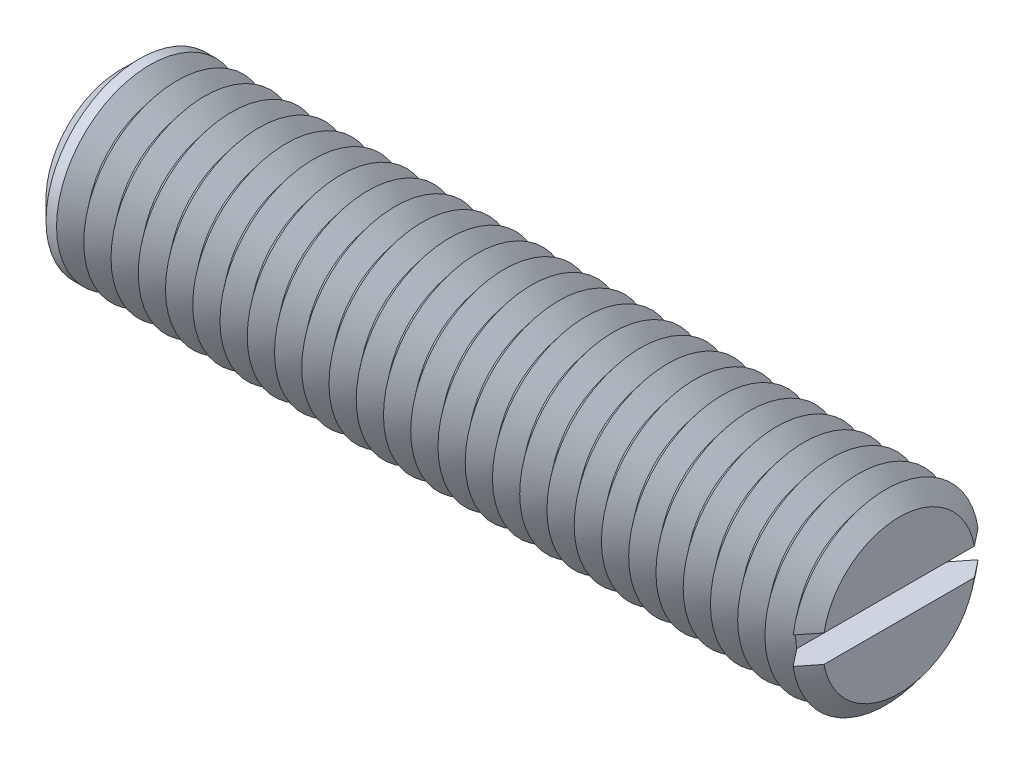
ISO-10303-21;
HEADER;
FILE_DESCRIPTION(('STEP AP214'),'2;1');
FILE_NAME('part.step','',(''),(''),'','','');
FILE_SCHEMA(('AUTOMOTIVE_DESIGN { 1 0 10303 214 1 1 1 1 }'));
ENDSEC;
DATA;
#1=APPLICATION_CONTEXT('core data for automotive mechanical design processes');
#2=APPLICATION_PROTOCOL_DEFINITION('international standard','automotive_design',2000,#1);
#3=PRODUCT_CONTEXT('',#1,'mechanical');
#4=PRODUCT('Part','Part','',(#3));
#5=PRODUCT_RELATED_PRODUCT_CATEGORY('part','',(#4));
#6=PRODUCT_DEFINITION_FORMATION('','',#4);
#7=PRODUCT_DEFINITION_CONTEXT('part definition',#1,'design');
#8=PRODUCT_DEFINITION('design','',#6,#7);
#9=PRODUCT_DEFINITION_SHAPE('','',#8);
#10=(LENGTH_UNIT() NAMED_UNIT(*) SI_UNIT(.MILLI.,.METRE.));
#11=(NAMED_UNIT(*) PLANE_ANGLE_UNIT() SI_UNIT($,.RADIAN.));
#12=(NAMED_UNIT(*) SI_UNIT($,.STERADIAN.) SOLID_ANGLE_UNIT());
#13=UNCERTAINTY_MEASURE_WITH_UNIT(LENGTH_MEASURE(1.E-05),#10,'distance_accuracy_value','');
#14=(GEOMETRIC_REPRESENTATION_CONTEXT(3) GLOBAL_UNCERTAINTY_ASSIGNED_CONTEXT((#13)) GLOBAL_UNIT_ASSIGNED_CONTEXT((#10,
#11,#12)) REPRESENTATION_CONTEXT('',''));
#15=CARTESIAN_POINT('',(0.,0.,0.));
#16=DIRECTION('',(0.,0.,1.));
#17=DIRECTION('',(1.,0.,0.));
#18=AXIS2_PLACEMENT_3D('',#15,#16,#17);
#19=CARTESIAN_POINT('',(24.125,0.,0.));
#20=DIRECTION('',(1.,0.,0.));
#21=DIRECTION('',(0.,0.,-1.));
#22=AXIS2_PLACEMENT_3D('',#19,#20,#21);
#23=CONICAL_SURFACE('',#22,6.,0.895664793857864);
#24=CARTESIAN_POINT('',(24.125,0.,0.));
#25=DIRECTION('',(-1.,0.,0.));
#26=DIRECTION('',(0.,0.,1.));
#27=AXIS2_PLACEMENT_3D('',#24,#25,#26);
#28=CIRCLE('',#27,6.);
#29=CARTESIAN_POINT('',(24.125,-0.875,-5.93585503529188));
#30=VERTEX_POINT('',#29);
#31=CARTESIAN_POINT('',(24.125,-0.874999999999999,5.93585503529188));
#32=VERTEX_POINT('',#31);
#33=EDGE_CURVE('E117',#30,#32,#28,.T.);
#34=ORIENTED_EDGE('',*,*,#33,.T.);
#35=CARTESIAN_POINT('',(29.815666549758,-0.875,-13.0784023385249));
#36=CARTESIAN_POINT('',(29.4425848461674,-0.875,-12.6113718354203));
#37=CARTESIAN_POINT('',(29.0695485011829,-0.875,-12.1443050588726));
#38=CARTESIAN_POINT('',(28.3235952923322,-0.875,-11.2100035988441));
#39=CARTESIAN_POINT('',(27.9506784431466,-0.875,-10.7427689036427));
#40=CARTESIAN_POINT('',(27.2043910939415,-0.875,-9.80728158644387));
#41=CARTESIAN_POINT('',(26.8310209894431,-0.875,-9.33902864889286));
#42=CARTESIAN_POINT('',(26.084654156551,-0.875,-8.4022968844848));
#43=CARTESIAN_POINT('',(25.7116573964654,-0.875,-7.93381808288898));
#44=CARTESIAN_POINT('',(25.1431910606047,-0.875,-7.218940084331));
#45=CARTESIAN_POINT('',(24.9475150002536,-0.875,-6.97270509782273));
#46=CARTESIAN_POINT('',(24.5563780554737,-0.875,-6.4800601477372));
#47=CARTESIAN_POINT('',(24.360917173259,-0.875,-6.23365018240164));
#48=CARTESIAN_POINT('',(23.9702437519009,-0.875,-5.74051596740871));
#49=CARTESIAN_POINT('',(23.7750313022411,-0.875,-5.49379164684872));
#50=CARTESIAN_POINT('',(23.3850627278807,-0.875,-4.99999724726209));
#51=CARTESIAN_POINT('',(23.1903065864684,-0.875,-4.75292718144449));
#52=CARTESIAN_POINT('',(22.8017454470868,-0.875,-4.25854698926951));
#53=CARTESIAN_POINT('',(22.6079395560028,-0.875,-4.01123756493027));
#54=CARTESIAN_POINT('',(22.2214614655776,-0.875,-3.51567639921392));
#55=CARTESIAN_POINT('',(22.0287894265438,-0.875,-3.26742453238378));
#56=CARTESIAN_POINT('',(21.7415141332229,-0.875,-2.89382702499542));
#57=CARTESIAN_POINT('',(21.6460716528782,-0.875,-2.76912721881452));
#58=CARTESIAN_POINT('',(21.4560120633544,-0.875,-2.51908954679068));
#59=CARTESIAN_POINT('',(21.3613949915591,-0.875,-2.39375165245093));
#60=CARTESIAN_POINT('',(21.1734585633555,-0.875,-2.14215479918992));
#61=CARTESIAN_POINT('',(21.0801388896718,-0.875,-2.01589607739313));
#62=CARTESIAN_POINT('',(20.8955738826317,-0.875,-1.76187409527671));
#63=CARTESIAN_POINT('',(20.8043283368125,-0.875,-1.63411099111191));
#64=CARTESIAN_POINT('',(20.6947335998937,-0.875,-1.47575777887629));
#65=CARTESIAN_POINT('',(20.6745750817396,-0.875,-1.44642115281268));
#66=CARTESIAN_POINT('',(20.6344943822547,-0.875,-1.38758643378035));
#67=CARTESIAN_POINT('',(20.6145722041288,-0.875,-1.35808833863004));
#68=CARTESIAN_POINT('',(20.5552118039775,-0.875,-1.26931303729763));
#69=CARTESIAN_POINT('',(20.5161833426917,-0.875,-1.20976002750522));
#70=CARTESIAN_POINT('',(20.439598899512,-0.875,-1.08955604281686));
#71=CARTESIAN_POINT('',(20.4020457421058,-0.875,-1.02890325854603));
#72=CARTESIAN_POINT('',(20.3292052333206,-0.875,-0.906252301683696));
#73=CARTESIAN_POINT('',(20.2939174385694,-0.875,-0.844254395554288));
#74=CARTESIAN_POINT('',(20.2387563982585,-0.875,-0.74080235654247));
#75=CARTESIAN_POINT('',(20.217869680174,-0.875,-0.699896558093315));
#76=CARTESIAN_POINT('',(20.1780353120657,-0.875,-0.617162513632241));
#77=CARTESIAN_POINT('',(20.1590880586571,-0.875,-0.575334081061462));
#78=CARTESIAN_POINT('',(20.106232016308,-0.875,-0.448426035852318));
#79=CARTESIAN_POINT('',(20.0761075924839,-0.875,-0.361569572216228));
#80=CARTESIAN_POINT('',(20.0472166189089,-0.875,-0.240214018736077));
#81=CARTESIAN_POINT('',(20.0406925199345,-0.875,-0.207555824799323));
#82=CARTESIAN_POINT('',(20.0303887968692,-0.875,-0.141816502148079));
#83=CARTESIAN_POINT('',(20.0266076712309,-0.875,-0.108735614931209));
#84=CARTESIAN_POINT('',(20.0220436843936,-0.875,-0.0424543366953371));
#85=CARTESIAN_POINT('',(20.0212526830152,-0.875,-0.00925451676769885));
#86=CARTESIAN_POINT('',(20.022702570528,-0.875,0.0570804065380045));
#87=CARTESIAN_POINT('',(20.0249438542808,-0.875,0.0902155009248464));
#88=CARTESIAN_POINT('',(20.0331880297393,-0.875,0.164063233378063));
#89=CARTESIAN_POINT('',(20.0399634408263,-0.875,0.204689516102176));
#90=CARTESIAN_POINT('',(20.0573167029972,-0.875,0.285126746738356));
#91=CARTESIAN_POINT('',(20.0678973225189,-0.875,0.324937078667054));
#92=CARTESIAN_POINT('',(20.0921930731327,-0.875,0.403898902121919));
#93=CARTESIAN_POINT('',(20.1059311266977,-0.875,0.443043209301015));
#94=CARTESIAN_POINT('',(20.1357974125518,-0.875,0.520385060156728));
#95=CARTESIAN_POINT('',(20.151925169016,-0.875,0.558582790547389));
#96=CARTESIAN_POINT('',(20.2021457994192,-0.875,0.669991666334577));
#97=CARTESIAN_POINT('',(20.2387706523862,-0.875,0.742052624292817));
#98=CARTESIAN_POINT('',(20.316117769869,-0.875,0.883956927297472));
#99=CARTESIAN_POINT('',(20.3568440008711,-0.875,0.953798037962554));
#100=CARTESIAN_POINT('',(20.4409804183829,-0.875,1.09208391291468));
#101=CARTESIAN_POINT('',(20.4843973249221,-0.875,1.16052456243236));
#102=CARTESIAN_POINT('',(20.5729384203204,-0.875,1.29629435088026));
#103=CARTESIAN_POINT('',(20.618062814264,-0.875,1.36362335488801));
#104=CARTESIAN_POINT('',(20.7096565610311,-0.875,1.49772496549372));
#105=CARTESIAN_POINT('',(20.7561302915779,-0.875,1.56449457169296));
#106=CARTESIAN_POINT('',(20.8499281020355,-0.875,1.69744165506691));
#107=CARTESIAN_POINT('',(20.8972522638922,-0.875,1.76361907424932));
#108=CARTESIAN_POINT('',(20.9924358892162,-0.875,1.89539956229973));
#109=CARTESIAN_POINT('',(21.0402941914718,-0.875,1.96100347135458));
#110=CARTESIAN_POINT('',(21.1364816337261,-0.875,2.09186112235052));
#111=CARTESIAN_POINT('',(21.1848107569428,-0.875,2.15711487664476));
#112=CARTESIAN_POINT('',(21.3290907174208,-0.875,2.35079303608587));
#113=CARTESIAN_POINT('',(21.425565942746,-0.875,2.47882657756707));
#114=CARTESIAN_POINT('',(21.6194152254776,-0.875,2.73421191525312));
#115=CARTESIAN_POINT('',(21.716789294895,-0.875,2.86156370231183));
#116=CARTESIAN_POINT('',(22.0098183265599,-0.875,3.24294102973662));
#117=CARTESIAN_POINT('',(22.2063709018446,-0.875,3.49627631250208));
#118=CARTESIAN_POINT('',(22.6008478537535,-0.875,4.00219025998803));
#119=CARTESIAN_POINT('',(22.7987731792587,-0.875,4.25476818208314));
#120=CARTESIAN_POINT('',(23.1953507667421,-0.875,4.75934213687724));
#121=CARTESIAN_POINT('',(23.394003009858,-0.875,5.01133818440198));
#122=CARTESIAN_POINT('',(23.7908446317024,-0.875,5.51379367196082));
#123=CARTESIAN_POINT('',(23.9890318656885,-0.875,5.76425480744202));
#124=CARTESIAN_POINT('',(24.3857195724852,-0.875,6.26493161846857));
#125=CARTESIAN_POINT('',(24.5842200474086,-0.875,6.51514729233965));
#126=CARTESIAN_POINT('',(25.1799499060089,-0.875,7.26541710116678));
#127=CARTESIAN_POINT('',(25.5775028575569,-0.875,7.76521426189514));
#128=CARTESIAN_POINT('',(26.2943115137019,-0.875,8.66550309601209));
#129=CARTESIAN_POINT('',(26.6134832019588,-0.875,9.06606170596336));
#130=CARTESIAN_POINT('',(27.2520581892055,-0.875,9.86704239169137));
#131=CARTESIAN_POINT('',(27.5714615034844,-0.875,10.2674644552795));
#132=CARTESIAN_POINT('',(28.2116162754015,-0.875,11.0697025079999));
#133=CARTESIAN_POINT('',(28.5323682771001,-0.875,11.4715180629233));
#134=CARTESIAN_POINT('',(29.1739570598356,-0.875,12.2750327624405));
#135=CARTESIAN_POINT('',(29.4947938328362,-0.875,12.6767319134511));
#136=CARTESIAN_POINT('',(29.815666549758,-0.875,13.0784023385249));
#137=B_SPLINE_CURVE_WITH_KNOTS('',3,(#35,#36,#37,#38,#39,#40,#41,#42,#43,#44,#45,#46,#47,#48,
#49,#50,#51,#52,#53,#54,#55,#56,#57,#58,#59,#60,#61,#62,#63,#64,#65,#66,#67,#68,#69,#70,#71,#72,
#73,#74,#75,#76,#77,#78,#79,#80,#81,#82,#83,#84,#85,#86,#87,#88,#89,#90,#91,#92,#93,#94,#95,#96,
#97,#98,#99,#100,#101,#102,#103,#104,#105,#106,#107,#108,#109,#110,#111,#112,#113,#114,#115,
#116,#117,#118,#119,#120,#121,#122,#123,#124,#125,#126,#127,#128,#129,#130,#131,#132,#133,#134,
#135,#136),.UNSPECIFIED.,.F.,.F.,(4,2,2,2,2,2,2,2,2,2,2,2,2,2,2,2,2,2,2,2,2,2,2,2,2,2,2,2,2,2,2,
2,2,2,2,2,2,2,2,2,2,2,2,2,2,2,2,2,2,2,4),(0.,1.79325603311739,3.58668207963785,5.38334403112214,
7.17983772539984,8.12338791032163,9.06694771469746,10.0107838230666,10.9545848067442,
11.8971886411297,12.8399226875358,13.3110192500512,13.7821370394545,14.2531375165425,
14.72408952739,14.8308734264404,14.9376587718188,15.1512485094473,15.3652290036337,
15.5791674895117,15.7169026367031,15.8546658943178,16.1289739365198,16.2287885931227,
16.3285485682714,16.4280367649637,16.5275379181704,16.6508760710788,16.7743041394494,
16.8986582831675,17.0229876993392,17.2652294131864,17.5077076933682,17.7508180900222,
17.9939577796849,18.2380016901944,18.4820692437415,18.7256822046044,18.9692865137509,
19.4502162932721,19.9311525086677,20.8930708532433,21.855738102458,22.8183805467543,
23.7765455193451,24.7347169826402,26.6505999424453,28.1871088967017,29.7237307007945,
31.2661438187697,32.8084427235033),.UNSPECIFIED.);
#138=CARTESIAN_POINT('',(23.25,-0.875,4.82848363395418));
#139=VERTEX_POINT('',#138);
#140=EDGE_CURVE('E109',#139,#32,#137,.T.);
#141=ORIENTED_EDGE('',*,*,#140,.F.);
#142=CARTESIAN_POINT('',(23.25,0.,0.));
#143=DIRECTION('',(-1.,0.,0.));
#144=DIRECTION('',(0.,0.,1.));
#145=AXIS2_PLACEMENT_3D('',#142,#143,#144);
#146=CIRCLE('',#145,4.90712535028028);
#147=CARTESIAN_POINT('',(23.25,-0.875,-4.82848363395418));
#148=VERTEX_POINT('',#147);
#149=EDGE_CURVE('E441',#148,#139,#146,.T.);
#150=ORIENTED_EDGE('',*,*,#149,.F.);
#151=EDGE_CURVE('E58',#30,#148,#137,.T.);
#152=ORIENTED_EDGE('',*,*,#151,.F.);
#153=EDGE_LOOP('',(#34,#141,#150,#152));
#154=FACE_BOUND('',#153,.T.);
#155=ADVANCED_FACE('F37',(#154),#23,.T.);
#156=CARTESIAN_POINT('',(24.125,0.874999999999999,5.93585503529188));
#157=VERTEX_POINT('',#156);
#158=CARTESIAN_POINT('',(24.125,0.874999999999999,-5.93585503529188));
#159=VERTEX_POINT('',#158);
#160=EDGE_CURVE('E100',#157,#159,#28,.T.);
#161=ORIENTED_EDGE('',*,*,#160,.T.);
#162=CARTESIAN_POINT('',(29.815666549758,0.875,13.0784023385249));
#163=CARTESIAN_POINT('',(29.4425848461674,0.875,12.6113718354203));
#164=CARTESIAN_POINT('',(29.0695485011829,0.875,12.1443050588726));
#165=CARTESIAN_POINT('',(28.3235952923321,0.875,11.2100035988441));
#166=CARTESIAN_POINT('',(27.9506784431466,0.875,10.7427689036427));
#167=CARTESIAN_POINT('',(27.2043910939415,0.875,9.80728158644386));
#168=CARTESIAN_POINT('',(26.8310209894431,0.875,9.33902864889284));
#169=CARTESIAN_POINT('',(26.084654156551,0.875,8.40229688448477));
#170=CARTESIAN_POINT('',(25.7116573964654,0.875,7.93381808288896));
#171=CARTESIAN_POINT('',(25.1431910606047,0.875,7.21894008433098));
#172=CARTESIAN_POINT('',(24.9475150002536,0.875,6.97270509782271));
#173=CARTESIAN_POINT('',(24.5563780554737,0.875,6.48006014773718));
#174=CARTESIAN_POINT('',(24.3609171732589,0.875,6.23365018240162));
#175=CARTESIAN_POINT('',(23.9702437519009,0.875,5.7405159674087));
#176=CARTESIAN_POINT('',(23.7750313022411,0.875,5.49379164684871));
#177=CARTESIAN_POINT('',(23.3850627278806,0.875,4.99999724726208));
#178=CARTESIAN_POINT('',(23.1903065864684,0.875,4.75292718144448));
#179=CARTESIAN_POINT('',(22.8017454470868,0.875,4.2585469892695));
#180=CARTESIAN_POINT('',(22.6079395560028,0.875,4.01123756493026));
#181=CARTESIAN_POINT('',(22.2214614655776,0.875,3.51567639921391));
#182=CARTESIAN_POINT('',(22.0287894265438,0.875,3.26742453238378));
#183=CARTESIAN_POINT('',(21.7415141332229,0.875,2.89382702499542));
#184=CARTESIAN_POINT('',(21.6460716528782,0.875,2.76912721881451));
#185=CARTESIAN_POINT('',(21.4560120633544,0.875,2.51908954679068));
#186=CARTESIAN_POINT('',(21.3613949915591,0.875,2.39375165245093));
#187=CARTESIAN_POINT('',(21.1734585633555,0.875,2.14215479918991));
#188=CARTESIAN_POINT('',(21.0801388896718,0.875,2.01589607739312));
#189=CARTESIAN_POINT('',(20.8955738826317,0.875,1.7618740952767));
#190=CARTESIAN_POINT('',(20.8043283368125,0.875,1.63411099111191));
#191=CARTESIAN_POINT('',(20.6947335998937,0.875,1.47575777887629));
#192=CARTESIAN_POINT('',(20.6745750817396,0.875,1.44642115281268));
#193=CARTESIAN_POINT('',(20.6344943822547,0.875,1.38758643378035));
#194=CARTESIAN_POINT('',(20.6145722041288,0.875,1.35808833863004));
#195=CARTESIAN_POINT('',(20.5552118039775,0.875,1.26931303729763));
#196=CARTESIAN_POINT('',(20.5161833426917,0.875,1.20976002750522));
#197=CARTESIAN_POINT('',(20.439598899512,0.875,1.08955604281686));
#198=CARTESIAN_POINT('',(20.4020457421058,0.875,1.02890325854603));
#199=CARTESIAN_POINT('',(20.3292052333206,0.875,0.906252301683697));
#200=CARTESIAN_POINT('',(20.2939174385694,0.875,0.844254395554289));
#201=CARTESIAN_POINT('',(20.2387563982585,0.875,0.740802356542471));
#202=CARTESIAN_POINT('',(20.217869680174,0.875,0.699896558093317));
#203=CARTESIAN_POINT('',(20.1780353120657,0.875,0.617162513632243));
#204=CARTESIAN_POINT('',(20.1590880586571,0.875,0.575334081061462));
#205=CARTESIAN_POINT('',(20.106232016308,0.875,0.448426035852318));
#206=CARTESIAN_POINT('',(20.0761075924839,0.875,0.361569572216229));
#207=CARTESIAN_POINT('',(20.0472166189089,0.875,0.240214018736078));
#208=CARTESIAN_POINT('',(20.0406925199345,0.875,0.207555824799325));
#209=CARTESIAN_POINT('',(20.0303887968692,0.875,0.141816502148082));
#210=CARTESIAN_POINT('',(20.0266076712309,0.875,0.108735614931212));
#211=CARTESIAN_POINT('',(20.0220436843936,0.875,0.0424543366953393));
#212=CARTESIAN_POINT('',(20.0212526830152,0.875,0.00925451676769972));
#213=CARTESIAN_POINT('',(20.022702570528,0.875,-0.0570804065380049));
#214=CARTESIAN_POINT('',(20.0249438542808,0.875,-0.0902155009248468));
#215=CARTESIAN_POINT('',(20.0331880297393,0.875,-0.164063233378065));
#216=CARTESIAN_POINT('',(20.0399634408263,0.875,-0.20468951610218));
#217=CARTESIAN_POINT('',(20.0573167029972,0.875,-0.28512674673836));
#218=CARTESIAN_POINT('',(20.0678973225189,0.875,-0.324937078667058));
#219=CARTESIAN_POINT('',(20.0921930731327,0.875,-0.403898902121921));
#220=CARTESIAN_POINT('',(20.1059311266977,0.875,-0.443043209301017));
#221=CARTESIAN_POINT('',(20.1357974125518,0.875,-0.520385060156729));
#222=CARTESIAN_POINT('',(20.151925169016,0.875,-0.55858279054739));
#223=CARTESIAN_POINT('',(20.2021457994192,0.875,-0.669991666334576));
#224=CARTESIAN_POINT('',(20.2387706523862,0.875,-0.742052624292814));
#225=CARTESIAN_POINT('',(20.316117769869,0.875,-0.883956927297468));
#226=CARTESIAN_POINT('',(20.3568440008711,0.875,-0.953798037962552));
#227=CARTESIAN_POINT('',(20.4409804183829,0.875,-1.09208391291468));
#228=CARTESIAN_POINT('',(20.4843973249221,0.875,-1.16052456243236));
#229=CARTESIAN_POINT('',(20.5729384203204,0.875,-1.29629435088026));
#230=CARTESIAN_POINT('',(20.618062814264,0.875,-1.36362335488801));
#231=CARTESIAN_POINT('',(20.7096565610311,0.875,-1.49772496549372));
#232=CARTESIAN_POINT('',(20.7561302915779,0.875,-1.56449457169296));
#233=CARTESIAN_POINT('',(20.8499281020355,0.875,-1.69744165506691));
#234=CARTESIAN_POINT('',(20.8972522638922,0.875,-1.76361907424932));
#235=CARTESIAN_POINT('',(20.9924358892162,0.875,-1.89539956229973));
#236=CARTESIAN_POINT('',(21.0402941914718,0.875,-1.96100347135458));
#237=CARTESIAN_POINT('',(21.1364816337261,0.875,-2.09186112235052));
#238=CARTESIAN_POINT('',(21.1848107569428,0.875,-2.15711487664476));
#239=CARTESIAN_POINT('',(21.3290907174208,0.875,-2.35079303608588));
#240=CARTESIAN_POINT('',(21.425565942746,0.875,-2.47882657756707));
#241=CARTESIAN_POINT('',(21.6194152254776,0.875,-2.73421191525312));
#242=CARTESIAN_POINT('',(21.716789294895,0.875,-2.86156370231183));
#243=CARTESIAN_POINT('',(22.0098183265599,0.875,-3.24294102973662));
#244=CARTESIAN_POINT('',(22.2063709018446,0.875,-3.49627631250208));
#245=CARTESIAN_POINT('',(22.6008478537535,0.875,-4.00219025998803));
#246=CARTESIAN_POINT('',(22.7987731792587,0.875,-4.25476818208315));
#247=CARTESIAN_POINT('',(23.1953507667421,0.875,-4.75934213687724));
#248=CARTESIAN_POINT('',(23.394003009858,0.875,-5.01133818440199));
#249=CARTESIAN_POINT('',(23.7908446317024,0.875,-5.51379367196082));
#250=CARTESIAN_POINT('',(23.9890318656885,0.875,-5.76425480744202));
#251=CARTESIAN_POINT('',(24.3857195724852,0.875,-6.26493161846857));
#252=CARTESIAN_POINT('',(24.5842200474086,0.875,-6.51514729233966));
#253=CARTESIAN_POINT('',(25.1799499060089,0.875,-7.26541710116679));
#254=CARTESIAN_POINT('',(25.5775028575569,0.875,-7.76521426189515));
#255=CARTESIAN_POINT('',(26.294311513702,0.875,-8.6655030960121));
#256=CARTESIAN_POINT('',(26.6134832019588,0.875,-9.06606170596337));
#257=CARTESIAN_POINT('',(27.2520581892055,0.875,-9.86704239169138));
#258=CARTESIAN_POINT('',(27.5714615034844,0.875,-10.2674644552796));
#259=CARTESIAN_POINT('',(28.2116162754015,0.875,-11.0697025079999));
#260=CARTESIAN_POINT('',(28.5323682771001,0.875,-11.4715180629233));
#261=CARTESIAN_POINT('',(29.1739570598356,0.875,-12.2750327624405));
#262=CARTESIAN_POINT('',(29.4947938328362,0.875,-12.6767319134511));
#263=CARTESIAN_POINT('',(29.815666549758,0.875,-13.0784023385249));
#264=B_SPLINE_CURVE_WITH_KNOTS('',3,(#162,#163,#164,#165,#166,#167,#168,#169,#170,#171,#172,
#173,#174,#175,#176,#177,#178,#179,#180,#181,#182,#183,#184,#185,#186,#187,#188,#189,#190,#191,
#192,#193,#194,#195,#196,#197,#198,#199,#200,#201,#202,#203,#204,#205,#206,#207,#208,#209,#210,
#211,#212,#213,#214,#215,#216,#217,#218,#219,#220,#221,#222,#223,#224,#225,#226,#227,#228,#229,
#230,#231,#232,#233,#234,#235,#236,#237,#238,#239,#240,#241,#242,#243,#244,#245,#246,#247,#248,
#249,#250,#251,#252,#253,#254,#255,#256,#257,#258,#259,#260,#261,#262,#263),.UNSPECIFIED.,.F.,
.F.,(4,2,2,2,2,2,2,2,2,2,2,2,2,2,2,2,2,2,2,2,2,2,2,2,2,2,2,2,2,2,2,2,2,2,2,2,2,2,2,2,2,2,2,2,2,
2,2,2,2,2,4),(0.,1.7932560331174,3.58668207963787,5.38334403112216,7.17983772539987,
8.12338791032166,9.06694771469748,10.0107838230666,10.9545848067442,11.8971886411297,
12.8399226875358,13.3110192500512,13.7821370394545,14.2531375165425,14.72408952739,
14.8308734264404,14.9376587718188,15.1512485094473,15.3652290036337,15.5791674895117,
15.7169026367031,15.8546658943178,16.1289739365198,16.2287885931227,16.3285485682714,
16.4280367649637,16.5275379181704,16.6508760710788,16.7743041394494,16.8986582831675,
17.0229876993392,17.2652294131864,17.5077076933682,17.7508180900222,17.9939577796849,
18.2380016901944,18.4820692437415,18.7256822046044,18.9692865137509,19.4502162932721,
19.9311525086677,20.8930708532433,21.855738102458,22.8183805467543,23.7765455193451,
24.7347169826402,26.6505999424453,28.1871088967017,29.7237307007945,31.2661438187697,
32.8084427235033),.UNSPECIFIED.);
#265=CARTESIAN_POINT('',(23.25,0.875,-4.82848363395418));
#266=VERTEX_POINT('',#265);
#267=EDGE_CURVE('E110',#266,#159,#264,.T.);
#268=ORIENTED_EDGE('',*,*,#267,.F.);
#269=CARTESIAN_POINT('',(23.25,0.875,4.82848363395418));
#270=VERTEX_POINT('',#269);
#271=EDGE_CURVE('E103',#270,#266,#146,.T.);
#272=ORIENTED_EDGE('',*,*,#271,.F.);
#273=EDGE_CURVE('E97',#157,#270,#264,.T.);
#274=ORIENTED_EDGE('',*,*,#273,.F.);
#275=EDGE_LOOP('',(#161,#268,#272,#274));
#276=FACE_BOUND('',#275,.T.);
#277=ADVANCED_FACE('F99',(#276),#23,.T.);
#278=CARTESIAN_POINT('',(23.25,0.,0.));
#279=DIRECTION('',(-1.,0.,0.));
#280=DIRECTION('',(0.,0.,1.));
#281=AXIS2_PLACEMENT_3D('',#278,#279,#280);
#282=CONICAL_SURFACE('',#281,4.90712535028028,0.895664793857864);
#283=CARTESIAN_POINT('',(22.375,0.,0.));
#284=DIRECTION('',(-1.,0.,0.));
#285=DIRECTION('',(0.,0.,1.));
#286=AXIS2_PLACEMENT_3D('',#283,#284,#285);
#287=CIRCLE('',#286,6.);
#288=CARTESIAN_POINT('',(22.375,0.,6.));
#289=VERTEX_POINT('',#288);
#290=EDGE_CURVE('E425',#289,#289,#287,.T.);
#291=ORIENTED_EDGE('',*,*,#290,.F.);
#292=EDGE_LOOP('',(#291));
#293=FACE_BOUND('',#292,.T.);
#294=ORIENTED_EDGE('',*,*,#271,.T.);
#295=EDGE_CURVE('E434',#266,#148,#146,.T.);
#296=ORIENTED_EDGE('',*,*,#295,.T.);
#297=ORIENTED_EDGE('',*,*,#149,.T.);
#298=EDGE_CURVE('E432',#139,#270,#146,.T.);
#299=ORIENTED_EDGE('',*,*,#298,.T.);
#300=EDGE_LOOP('',(#294,#296,#297,#299));
#301=FACE_BOUND('',#300,.T.);
#302=ADVANCED_FACE('F167',(#293,#301),#282,.T.);
#303=CARTESIAN_POINT('',(25.,0.,0.));
#304=DIRECTION('',(1.,0.,0.));
#305=DIRECTION('',(0.,0.,-1.));
#306=AXIS2_PLACEMENT_3D('',#303,#304,#305);
#307=PLANE('',#306);
#308=CARTESIAN_POINT('',(25.,0.,0.));
#309=DIRECTION('',(-1.,0.,0.));
#310=DIRECTION('',(0.,0.,1.));
#311=AXIS2_PLACEMENT_3D('',#308,#309,#310);
#312=CIRCLE('',#311,4.90712535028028);
#313=CARTESIAN_POINT('',(25.,0.875,4.82848363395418));
#314=VERTEX_POINT('',#313);
#315=CARTESIAN_POINT('',(25.,0.875,-4.82848363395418));
#316=VERTEX_POINT('',#315);
#317=EDGE_CURVE('E159',#314,#316,#312,.T.);
#318=ORIENTED_EDGE('',*,*,#317,.F.);
#319=DIRECTION('',(0.,0.,1.));
#320=VECTOR('',#319,1.);
#321=CARTESIAN_POINT('',(25.,0.875,0.));
#322=LINE('',#321,#320);
#323=EDGE_CURVE('E122',#316,#314,#322,.T.);
#324=ORIENTED_EDGE('',*,*,#323,.F.);
#325=EDGE_LOOP('',(#318,#324));
#326=FACE_BOUND('',#325,.T.);
#327=ADVANCED_FACE('F171',(#326),#307,.T.);
#328=CARTESIAN_POINT('',(25.,-0.875,-4.82848363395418));
#329=VERTEX_POINT('',#328);
#330=CARTESIAN_POINT('',(25.,-0.875,4.82848363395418));
#331=VERTEX_POINT('',#330);
#332=EDGE_CURVE('E66',#329,#331,#312,.T.);
#333=ORIENTED_EDGE('',*,*,#332,.F.);
#334=DIRECTION('',(0.,0.,-1.));
#335=VECTOR('',#334,1.);
#336=CARTESIAN_POINT('',(25.,-0.875,0.));
#337=LINE('',#336,#335);
#338=EDGE_CURVE('E136',#331,#329,#337,.T.);
#339=ORIENTED_EDGE('',*,*,#338,.F.);
#340=EDGE_LOOP('',(#333,#339));
#341=FACE_BOUND('',#340,.T.);
#342=ADVANCED_FACE('F199',(#341),#307,.T.);
#343=CARTESIAN_POINT('',(25.,0.,0.));
#344=DIRECTION('',(-1.,0.,0.));
#345=DIRECTION('',(0.,0.,1.));
#346=AXIS2_PLACEMENT_3D('',#343,#344,#345);
#347=CONICAL_SURFACE('',#346,4.90712535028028,0.895664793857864);
#348=ORIENTED_EDGE('',*,*,#160,.F.);
#349=CARTESIAN_POINT('',(18.434333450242,0.875,-13.0784023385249));
#350=CARTESIAN_POINT('',(18.8074151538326,0.875,-12.6113718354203));
#351=CARTESIAN_POINT('',(19.1804514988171,0.875,-12.1443050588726));
#352=CARTESIAN_POINT('',(19.9264047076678,0.875,-11.2100035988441));
#353=CARTESIAN_POINT('',(20.2993215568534,0.875,-10.7427689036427));
#354=CARTESIAN_POINT('',(21.0456089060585,0.875,-9.80728158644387));
#355=CARTESIAN_POINT('',(21.4189790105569,0.875,-9.33902864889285));
#356=CARTESIAN_POINT('',(22.165345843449,0.875,-8.40229688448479));
#357=CARTESIAN_POINT('',(22.5383426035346,0.875,-7.93381808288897));
#358=CARTESIAN_POINT('',(23.1068089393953,0.875,-7.21894008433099));
#359=CARTESIAN_POINT('',(23.3024849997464,0.875,-6.97270509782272));
#360=CARTESIAN_POINT('',(23.6936219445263,0.875,-6.48006014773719));
#361=CARTESIAN_POINT('',(23.889082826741,0.875,-6.23365018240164));
#362=CARTESIAN_POINT('',(24.2797562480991,0.875,-5.74051596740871));
#363=CARTESIAN_POINT('',(24.4749686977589,0.875,-5.49379164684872));
#364=CARTESIAN_POINT('',(24.8649372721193,0.875,-4.99999724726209));
#365=CARTESIAN_POINT('',(25.0596934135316,0.875,-4.75292718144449));
#366=CARTESIAN_POINT('',(25.4482545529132,0.875,-4.25854698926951));
#367=CARTESIAN_POINT('',(25.6420604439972,0.875,-4.01123756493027));
#368=CARTESIAN_POINT('',(26.0285385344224,0.875,-3.51567639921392));
#369=CARTESIAN_POINT('',(26.2212105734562,0.875,-3.26742453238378));
#370=CARTESIAN_POINT('',(26.5084858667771,0.875,-2.89382702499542));
#371=CARTESIAN_POINT('',(26.6039283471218,0.875,-2.76912721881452));
#372=CARTESIAN_POINT('',(26.7939879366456,0.875,-2.51908954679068));
#373=CARTESIAN_POINT('',(26.8886050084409,0.875,-2.39375165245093));
#374=CARTESIAN_POINT('',(27.0765414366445,0.875,-2.14215479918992));
#375=CARTESIAN_POINT('',(27.1698611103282,0.875,-2.01589607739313));
#376=CARTESIAN_POINT('',(27.3544261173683,0.875,-1.7618740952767));
#377=CARTESIAN_POINT('',(27.4456716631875,0.875,-1.63411099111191));
#378=CARTESIAN_POINT('',(27.5552664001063,0.875,-1.47575777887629));
#379=CARTESIAN_POINT('',(27.5754249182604,0.875,-1.44642115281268));
#380=CARTESIAN_POINT('',(27.6155056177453,0.875,-1.38758643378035));
#381=CARTESIAN_POINT('',(27.6354277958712,0.875,-1.35808833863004));
#382=CARTESIAN_POINT('',(27.6947881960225,0.875,-1.26931303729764));
#383=CARTESIAN_POINT('',(27.7338166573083,0.875,-1.20976002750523));
#384=CARTESIAN_POINT('',(27.810401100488,0.875,-1.08955604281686));
#385=CARTESIAN_POINT('',(27.8479542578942,0.875,-1.02890325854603));
#386=CARTESIAN_POINT('',(27.9207947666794,0.875,-0.9062523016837));
#387=CARTESIAN_POINT('',(27.9560825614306,0.875,-0.844254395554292));
#388=CARTESIAN_POINT('',(28.0112436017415,0.875,-0.740802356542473));
#389=CARTESIAN_POINT('',(28.032130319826,0.875,-0.699896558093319));
#390=CARTESIAN_POINT('',(28.0719646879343,0.875,-0.617162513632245));
#391=CARTESIAN_POINT('',(28.0909119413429,0.875,-0.575334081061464));
#392=CARTESIAN_POINT('',(28.143767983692,0.875,-0.44842603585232));
#393=CARTESIAN_POINT('',(28.1738924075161,0.875,-0.36156957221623));
#394=CARTESIAN_POINT('',(28.2027833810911,0.875,-0.240214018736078));
#395=CARTESIAN_POINT('',(28.2093074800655,0.875,-0.207555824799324));
#396=CARTESIAN_POINT('',(28.2196112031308,0.875,-0.141816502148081));
#397=CARTESIAN_POINT('',(28.2233923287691,0.875,-0.108735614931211));
#398=CARTESIAN_POINT('',(28.2279563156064,0.875,-0.0424543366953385));
#399=CARTESIAN_POINT('',(28.2287473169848,0.875,-0.00925451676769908));
#400=CARTESIAN_POINT('',(28.227297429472,0.875,0.0570804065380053));
#401=CARTESIAN_POINT('',(28.2250561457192,0.875,0.0902155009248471));
#402=CARTESIAN_POINT('',(28.2168119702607,0.875,0.164063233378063));
#403=CARTESIAN_POINT('',(28.2100365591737,0.875,0.204689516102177));
#404=CARTESIAN_POINT('',(28.1926832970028,0.875,0.285126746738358));
#405=CARTESIAN_POINT('',(28.1821026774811,0.875,0.324937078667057));
#406=CARTESIAN_POINT('',(28.1578069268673,0.875,0.403898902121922));
#407=CARTESIAN_POINT('',(28.1440688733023,0.875,0.443043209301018));
#408=CARTESIAN_POINT('',(28.1142025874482,0.875,0.52038506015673));
#409=CARTESIAN_POINT('',(28.098074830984,0.875,0.558582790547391));
#410=CARTESIAN_POINT('',(28.0478542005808,0.875,0.669991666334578));
#411=CARTESIAN_POINT('',(28.0112293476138,0.875,0.742052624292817));
#412=CARTESIAN_POINT('',(27.933882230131,0.875,0.883956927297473));
#413=CARTESIAN_POINT('',(27.8931559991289,0.875,0.953798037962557));
#414=CARTESIAN_POINT('',(27.8090195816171,0.875,1.09208391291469));
#415=CARTESIAN_POINT('',(27.7656026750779,0.875,1.16052456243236));
#416=CARTESIAN_POINT('',(27.6770615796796,0.875,1.29629435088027));
#417=CARTESIAN_POINT('',(27.631937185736,0.875,1.36362335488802));
#418=CARTESIAN_POINT('',(27.5403434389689,0.875,1.49772496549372));
#419=CARTESIAN_POINT('',(27.4938697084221,0.875,1.56449457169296));
#420=CARTESIAN_POINT('',(27.4000718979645,0.875,1.69744165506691));
#421=CARTESIAN_POINT('',(27.3527477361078,0.875,1.76361907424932));
#422=CARTESIAN_POINT('',(27.2575641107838,0.875,1.89539956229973));
#423=CARTESIAN_POINT('',(27.2097058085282,0.875,1.96100347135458));
#424=CARTESIAN_POINT('',(27.1135183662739,0.875,2.09186112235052));
#425=CARTESIAN_POINT('',(27.0651892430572,0.875,2.15711487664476));
#426=CARTESIAN_POINT('',(26.9209092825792,0.875,2.35079303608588));
#427=CARTESIAN_POINT('',(26.824434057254,0.875,2.47882657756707));
#428=CARTESIAN_POINT('',(26.6305847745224,0.875,2.73421191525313));
#429=CARTESIAN_POINT('',(26.533210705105,0.875,2.86156370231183));
#430=CARTESIAN_POINT('',(26.2401816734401,0.875,3.24294102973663));
#431=CARTESIAN_POINT('',(26.0436290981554,0.875,3.49627631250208));
#432=CARTESIAN_POINT('',(25.6491521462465,0.875,4.00219025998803));
#433=CARTESIAN_POINT('',(25.4512268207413,0.875,4.25476818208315));
#434=CARTESIAN_POINT('',(25.0546492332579,0.875,4.75934213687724));
#435=CARTESIAN_POINT('',(24.855996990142,0.875,5.01133818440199));
#436=CARTESIAN_POINT('',(24.4591553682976,0.875,5.51379367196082));
#437=CARTESIAN_POINT('',(24.2609681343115,0.875,5.76425480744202));
#438=CARTESIAN_POINT('',(23.8642804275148,0.875,6.26493161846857));
#439=CARTESIAN_POINT('',(23.6657799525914,0.875,6.51514729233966));
#440=CARTESIAN_POINT('',(23.0700500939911,0.875,7.26541710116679));
#441=CARTESIAN_POINT('',(22.6724971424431,0.875,7.76521426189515));
#442=CARTESIAN_POINT('',(21.955688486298,0.875,8.6655030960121));
#443=CARTESIAN_POINT('',(21.6365167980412,0.875,9.06606170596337));
#444=CARTESIAN_POINT('',(20.9979418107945,0.875,9.86704239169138));
#445=CARTESIAN_POINT('',(20.6785384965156,0.875,10.2674644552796));
#446=CARTESIAN_POINT('',(20.0383837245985,0.875,11.0697025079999));
#447=CARTESIAN_POINT('',(19.7176317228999,0.875,11.4715180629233));
#448=CARTESIAN_POINT('',(19.0760429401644,0.875,12.2750327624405));
#449=CARTESIAN_POINT('',(18.7552061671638,0.875,12.6767319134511));
#450=CARTESIAN_POINT('',(18.434333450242,0.875,13.0784023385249));
#451=B_SPLINE_CURVE_WITH_KNOTS('',3,(#349,#350,#351,#352,#353,#354,#355,#356,#357,#358,#359,
#360,#361,#362,#363,#364,#365,#366,#367,#368,#369,#370,#371,#372,#373,#374,#375,#376,#377,#378,
#379,#380,#381,#382,#383,#384,#385,#386,#387,#388,#389,#390,#391,#392,#393,#394,#395,#396,#397,
#398,#399,#400,#401,#402,#403,#404,#405,#406,#407,#408,#409,#410,#411,#412,#413,#414,#415,#416,
#417,#418,#419,#420,#421,#422,#423,#424,#425,#426,#427,#428,#429,#430,#431,#432,#433,#434,#435,
#436,#437,#438,#439,#440,#441,#442,#443,#444,#445,#446,#447,#448,#449,#450),.UNSPECIFIED.,.F.,
.F.,(4,2,2,2,2,2,2,2,2,2,2,2,2,2,2,2,2,2,2,2,2,2,2,2,2,2,2,2,2,2,2,2,2,2,2,2,2,2,2,2,2,2,2,2,2,
2,2,2,2,2,4),(0.,1.79325603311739,3.58668207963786,5.38334403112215,7.17983772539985,
8.12338791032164,9.06694771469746,10.0107838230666,10.9545848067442,11.8971886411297,
12.8399226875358,13.3110192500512,13.7821370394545,14.2531375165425,14.72408952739,
14.8308734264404,14.9376587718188,15.1512485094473,15.3652290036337,15.5791674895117,
15.7169026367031,15.8546658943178,16.1289739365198,16.2287885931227,16.3285485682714,
16.4280367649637,16.5275379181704,16.6508760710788,16.7743041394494,16.8986582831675,
17.0229876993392,17.2652294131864,17.5077076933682,17.7508180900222,17.9939577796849,
18.2380016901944,18.4820692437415,18.7256822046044,18.9692865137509,19.4502162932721,
19.9311525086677,20.8930708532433,21.855738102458,22.8183805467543,23.7765455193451,
24.7347169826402,26.6505999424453,28.1871088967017,29.7237307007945,31.2661438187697,
32.8084427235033),.UNSPECIFIED.);
#452=EDGE_CURVE('E41',#314,#157,#451,.T.);
#453=ORIENTED_EDGE('',*,*,#452,.F.);
#454=ORIENTED_EDGE('',*,*,#317,.T.);
#455=EDGE_CURVE('E11',#159,#316,#451,.T.);
#456=ORIENTED_EDGE('',*,*,#455,.F.);
#457=EDGE_LOOP('',(#348,#453,#454,#456));
#458=FACE_BOUND('',#457,.T.);
#459=ADVANCED_FACE('F114',(#458),#347,.T.);
#460=CARTESIAN_POINT('',(25.,0.875,-9.));
#461=DIRECTION('',(0.,1.,0.));
#462=DIRECTION('',(0.,0.,1.));
#463=AXIS2_PLACEMENT_3D('',#460,#461,#462);
#464=PLANE('',#463);
#465=ORIENTED_EDGE('',*,*,#452,.T.);
#466=ORIENTED_EDGE('',*,*,#273,.T.);
#467=DIRECTION('',(0.,0.,1.));
#468=VECTOR('',#467,1.);
#469=CARTESIAN_POINT('',(23.25,0.875,-9.));
#470=LINE('',#469,#468);
#471=EDGE_CURVE('E144',#266,#270,#470,.T.);
#472=ORIENTED_EDGE('',*,*,#471,.F.);
#473=ORIENTED_EDGE('',*,*,#267,.T.);
#474=ORIENTED_EDGE('',*,*,#455,.T.);
#475=ORIENTED_EDGE('',*,*,#323,.T.);
#476=EDGE_LOOP('',(#465,#466,#472,#473,#474,#475));
#477=FACE_BOUND('',#476,.T.);
#478=ADVANCED_FACE('F120',(#477),#464,.F.);
#479=ORIENTED_EDGE('',*,*,#33,.F.);
#480=CARTESIAN_POINT('',(18.434333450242,-0.875,13.0784023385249));
#481=CARTESIAN_POINT('',(18.8074151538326,-0.875,12.6113718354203));
#482=CARTESIAN_POINT('',(19.1804514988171,-0.875,12.1443050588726));
#483=CARTESIAN_POINT('',(19.9264047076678,-0.875,11.2100035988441));
#484=CARTESIAN_POINT('',(20.2993215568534,-0.875,10.7427689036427));
#485=CARTESIAN_POINT('',(21.0456089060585,-0.875,9.80728158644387));
#486=CARTESIAN_POINT('',(21.4189790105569,-0.875,9.33902864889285));
#487=CARTESIAN_POINT('',(22.165345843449,-0.875,8.40229688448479));
#488=CARTESIAN_POINT('',(22.5383426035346,-0.875,7.93381808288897));
#489=CARTESIAN_POINT('',(23.1068089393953,-0.875,7.21894008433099));
#490=CARTESIAN_POINT('',(23.3024849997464,-0.875,6.97270509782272));
#491=CARTESIAN_POINT('',(23.6936219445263,-0.875,6.48006014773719));
#492=CARTESIAN_POINT('',(23.889082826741,-0.875,6.23365018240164));
#493=CARTESIAN_POINT('',(24.2797562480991,-0.875,5.74051596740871));
#494=CARTESIAN_POINT('',(24.4749686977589,-0.875,5.49379164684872));
#495=CARTESIAN_POINT('',(24.8649372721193,-0.875,4.99999724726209));
#496=CARTESIAN_POINT('',(25.0596934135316,-0.875,4.75292718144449));
#497=CARTESIAN_POINT('',(25.4482545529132,-0.875,4.25854698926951));
#498=CARTESIAN_POINT('',(25.6420604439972,-0.875,4.01123756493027));
#499=CARTESIAN_POINT('',(26.0285385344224,-0.875,3.51567639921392));
#500=CARTESIAN_POINT('',(26.2212105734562,-0.875,3.26742453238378));
#501=CARTESIAN_POINT('',(26.5084858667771,-0.875,2.89382702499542));
#502=CARTESIAN_POINT('',(26.6039283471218,-0.875,2.76912721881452));
#503=CARTESIAN_POINT('',(26.7939879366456,-0.875,2.51908954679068));
#504=CARTESIAN_POINT('',(26.8886050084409,-0.875,2.39375165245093));
#505=CARTESIAN_POINT('',(27.0765414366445,-0.875,2.14215479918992));
#506=CARTESIAN_POINT('',(27.1698611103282,-0.875,2.01589607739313));
#507=CARTESIAN_POINT('',(27.3544261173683,-0.875,1.7618740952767));
#508=CARTESIAN_POINT('',(27.4456716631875,-0.875,1.63411099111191));
#509=CARTESIAN_POINT('',(27.5552664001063,-0.875,1.47575777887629));
#510=CARTESIAN_POINT('',(27.5754249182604,-0.875,1.44642115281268));
#511=CARTESIAN_POINT('',(27.6155056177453,-0.875,1.38758643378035));
#512=CARTESIAN_POINT('',(27.6354277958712,-0.875,1.35808833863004));
#513=CARTESIAN_POINT('',(27.6947881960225,-0.875,1.26931303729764));
#514=CARTESIAN_POINT('',(27.7338166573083,-0.875,1.20976002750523));
#515=CARTESIAN_POINT('',(27.810401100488,-0.875,1.08955604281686));
#516=CARTESIAN_POINT('',(27.8479542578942,-0.875,1.02890325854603));
#517=CARTESIAN_POINT('',(27.9207947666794,-0.875,0.9062523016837));
#518=CARTESIAN_POINT('',(27.9560825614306,-0.875,0.844254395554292));
#519=CARTESIAN_POINT('',(28.0112436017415,-0.875,0.740802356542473));
#520=CARTESIAN_POINT('',(28.032130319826,-0.875,0.699896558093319));
#521=CARTESIAN_POINT('',(28.0719646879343,-0.875,0.617162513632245));
#522=CARTESIAN_POINT('',(28.0909119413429,-0.875,0.575334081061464));
#523=CARTESIAN_POINT('',(28.143767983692,-0.875,0.44842603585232));
#524=CARTESIAN_POINT('',(28.1738924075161,-0.875,0.36156957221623));
#525=CARTESIAN_POINT('',(28.2027833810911,-0.875,0.240214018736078));
#526=CARTESIAN_POINT('',(28.2093074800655,-0.875,0.207555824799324));
#527=CARTESIAN_POINT('',(28.2196112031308,-0.875,0.141816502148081));
#528=CARTESIAN_POINT('',(28.2233923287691,-0.875,0.108735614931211));
#529=CARTESIAN_POINT('',(28.2279563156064,-0.875,0.0424543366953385));
#530=CARTESIAN_POINT('',(28.2287473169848,-0.875,0.00925451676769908));
#531=CARTESIAN_POINT('',(28.227297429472,-0.875,-0.0570804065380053));
#532=CARTESIAN_POINT('',(28.2250561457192,-0.875,-0.0902155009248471));
#533=CARTESIAN_POINT('',(28.2168119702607,-0.875,-0.164063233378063));
#534=CARTESIAN_POINT('',(28.2100365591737,-0.875,-0.204689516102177));
#535=CARTESIAN_POINT('',(28.1926832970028,-0.875,-0.285126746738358));
#536=CARTESIAN_POINT('',(28.1821026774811,-0.875,-0.324937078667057));
#537=CARTESIAN_POINT('',(28.1578069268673,-0.875,-0.403898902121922));
#538=CARTESIAN_POINT('',(28.1440688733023,-0.875,-0.443043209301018));
#539=CARTESIAN_POINT('',(28.1142025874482,-0.875,-0.52038506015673));
#540=CARTESIAN_POINT('',(28.098074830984,-0.875,-0.558582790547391));
#541=CARTESIAN_POINT('',(28.0478542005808,-0.875,-0.669991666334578));
#542=CARTESIAN_POINT('',(28.0112293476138,-0.875,-0.742052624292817));
#543=CARTESIAN_POINT('',(27.933882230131,-0.875,-0.883956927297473));
#544=CARTESIAN_POINT('',(27.8931559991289,-0.875,-0.953798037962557));
#545=CARTESIAN_POINT('',(27.8090195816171,-0.875,-1.09208391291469));
#546=CARTESIAN_POINT('',(27.7656026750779,-0.875,-1.16052456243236));
#547=CARTESIAN_POINT('',(27.6770615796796,-0.875,-1.29629435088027));
#548=CARTESIAN_POINT('',(27.631937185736,-0.875,-1.36362335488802));
#549=CARTESIAN_POINT('',(27.5403434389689,-0.875,-1.49772496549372));
#550=CARTESIAN_POINT('',(27.4938697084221,-0.875,-1.56449457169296));
#551=CARTESIAN_POINT('',(27.4000718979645,-0.875,-1.69744165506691));
#552=CARTESIAN_POINT('',(27.3527477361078,-0.875,-1.76361907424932));
#553=CARTESIAN_POINT('',(27.2575641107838,-0.875,-1.89539956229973));
#554=CARTESIAN_POINT('',(27.2097058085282,-0.875,-1.96100347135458));
#555=CARTESIAN_POINT('',(27.1135183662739,-0.875,-2.09186112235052));
#556=CARTESIAN_POINT('',(27.0651892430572,-0.875,-2.15711487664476));
#557=CARTESIAN_POINT('',(26.9209092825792,-0.875,-2.35079303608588));
#558=CARTESIAN_POINT('',(26.824434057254,-0.875,-2.47882657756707));
#559=CARTESIAN_POINT('',(26.6305847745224,-0.875,-2.73421191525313));
#560=CARTESIAN_POINT('',(26.533210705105,-0.875,-2.86156370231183));
#561=CARTESIAN_POINT('',(26.2401816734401,-0.875,-3.24294102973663));
#562=CARTESIAN_POINT('',(26.0436290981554,-0.875,-3.49627631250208));
#563=CARTESIAN_POINT('',(25.6491521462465,-0.875,-4.00219025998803));
#564=CARTESIAN_POINT('',(25.4512268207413,-0.875,-4.25476818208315));
#565=CARTESIAN_POINT('',(25.0546492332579,-0.875,-4.75934213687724));
#566=CARTESIAN_POINT('',(24.855996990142,-0.875,-5.01133818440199));
#567=CARTESIAN_POINT('',(24.4591553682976,-0.875,-5.51379367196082));
#568=CARTESIAN_POINT('',(24.2609681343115,-0.875,-5.76425480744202));
#569=CARTESIAN_POINT('',(23.8642804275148,-0.875,-6.26493161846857));
#570=CARTESIAN_POINT('',(23.6657799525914,-0.875,-6.51514729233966));
#571=CARTESIAN_POINT('',(23.0700500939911,-0.875,-7.26541710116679));
#572=CARTESIAN_POINT('',(22.6724971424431,-0.875,-7.76521426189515));
#573=CARTESIAN_POINT('',(21.955688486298,-0.875,-8.6655030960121));
#574=CARTESIAN_POINT('',(21.6365167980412,-0.875,-9.06606170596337));
#575=CARTESIAN_POINT('',(20.9979418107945,-0.875,-9.86704239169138));
#576=CARTESIAN_POINT('',(20.6785384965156,-0.875,-10.2674644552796));
#577=CARTESIAN_POINT('',(20.0383837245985,-0.875,-11.0697025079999));
#578=CARTESIAN_POINT('',(19.7176317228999,-0.875,-11.4715180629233));
#579=CARTESIAN_POINT('',(19.0760429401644,-0.875,-12.2750327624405));
#580=CARTESIAN_POINT('',(18.7552061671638,-0.875,-12.6767319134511));
#581=CARTESIAN_POINT('',(18.434333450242,-0.875,-13.0784023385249));
#582=B_SPLINE_CURVE_WITH_KNOTS('',3,(#480,#481,#482,#483,#484,#485,#486,#487,#488,#489,#490,
#491,#492,#493,#494,#495,#496,#497,#498,#499,#500,#501,#502,#503,#504,#505,#506,#507,#508,#509,
#510,#511,#512,#513,#514,#515,#516,#517,#518,#519,#520,#521,#522,#523,#524,#525,#526,#527,#528,
#529,#530,#531,#532,#533,#534,#535,#536,#537,#538,#539,#540,#541,#542,#543,#544,#545,#546,#547,
#548,#549,#550,#551,#552,#553,#554,#555,#556,#557,#558,#559,#560,#561,#562,#563,#564,#565,#566,
#567,#568,#569,#570,#571,#572,#573,#574,#575,#576,#577,#578,#579,#580,#581),.UNSPECIFIED.,.F.,
.F.,(4,2,2,2,2,2,2,2,2,2,2,2,2,2,2,2,2,2,2,2,2,2,2,2,2,2,2,2,2,2,2,2,2,2,2,2,2,2,2,2,2,2,2,2,2,
2,2,2,2,2,4),(0.,1.79325603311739,3.58668207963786,5.38334403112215,7.17983772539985,
8.12338791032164,9.06694771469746,10.0107838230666,10.9545848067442,11.8971886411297,
12.8399226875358,13.3110192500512,13.7821370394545,14.2531375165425,14.72408952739,
14.8308734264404,14.9376587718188,15.1512485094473,15.3652290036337,15.5791674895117,
15.7169026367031,15.8546658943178,16.1289739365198,16.2287885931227,16.3285485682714,
16.4280367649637,16.5275379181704,16.6508760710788,16.7743041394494,16.8986582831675,
17.0229876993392,17.2652294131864,17.5077076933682,17.7508180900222,17.9939577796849,
18.2380016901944,18.4820692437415,18.7256822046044,18.9692865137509,19.4502162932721,
19.9311525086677,20.8930708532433,21.855738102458,22.8183805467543,23.7765455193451,
24.7347169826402,26.6505999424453,28.1871088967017,29.7237307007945,31.2661438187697,
32.8084427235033),.UNSPECIFIED.);
#583=EDGE_CURVE('E151',#329,#30,#582,.T.);
#584=ORIENTED_EDGE('',*,*,#583,.F.);
#585=ORIENTED_EDGE('',*,*,#332,.T.);
#586=EDGE_CURVE('E147',#32,#331,#582,.T.);
#587=ORIENTED_EDGE('',*,*,#586,.F.);
#588=EDGE_LOOP('',(#479,#584,#585,#587));
#589=FACE_BOUND('',#588,.T.);
#590=ADVANCED_FACE('F163',(#589),#347,.T.);
#591=CARTESIAN_POINT('',(25.,-0.875,-9.));
#592=DIRECTION('',(0.,-1.,0.));
#593=DIRECTION('',(0.,0.,-1.));
#594=AXIS2_PLACEMENT_3D('',#591,#592,#593);
#595=PLANE('',#594);
#596=ORIENTED_EDGE('',*,*,#583,.T.);
#597=ORIENTED_EDGE('',*,*,#151,.T.);
#598=DIRECTION('',(0.,0.,1.));
#599=VECTOR('',#598,1.);
#600=CARTESIAN_POINT('',(23.25,-0.875,-9.));
#601=LINE('',#600,#599);
#602=EDGE_CURVE('E143',#148,#139,#601,.T.);
#603=ORIENTED_EDGE('',*,*,#602,.T.);
#604=ORIENTED_EDGE('',*,*,#140,.T.);
#605=ORIENTED_EDGE('',*,*,#586,.T.);
#606=ORIENTED_EDGE('',*,*,#338,.T.);
#607=EDGE_LOOP('',(#596,#597,#603,#604,#605,#606));
#608=FACE_BOUND('',#607,.T.);
#609=ADVANCED_FACE('F160',(#608),#595,.F.);
#610=CARTESIAN_POINT('',(23.25,0.875,-9.));
#611=DIRECTION('',(-1.,0.,0.));
#612=DIRECTION('',(0.,0.,1.));
#613=AXIS2_PLACEMENT_3D('',#610,#611,#612);
#614=PLANE('',#613);
#615=ORIENTED_EDGE('',*,*,#602,.F.);
#616=ORIENTED_EDGE('',*,*,#295,.F.);
#617=ORIENTED_EDGE('',*,*,#471,.T.);
#618=ORIENTED_EDGE('',*,*,#298,.F.);
#619=EDGE_LOOP('',(#615,#616,#617,#618));
#620=FACE_BOUND('',#619,.T.);
#621=ADVANCED_FACE('F445',(#620),#614,.F.);
#622=CARTESIAN_POINT('',(21.5,0.,0.));
#623=DIRECTION('',(-1.,0.,0.));
#624=DIRECTION('',(0.,0.,1.));
#625=AXIS2_PLACEMENT_3D('',#622,#623,#624);
#626=CONICAL_SURFACE('',#625,4.90712535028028,0.895664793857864);
#627=CARTESIAN_POINT('',(20.625,0.,0.));
#628=DIRECTION('',(-1.,0.,0.));
#629=DIRECTION('',(0.,0.,1.));
#630=AXIS2_PLACEMENT_3D('',#627,#628,#629);
#631=CIRCLE('',#630,6.);
#632=CARTESIAN_POINT('',(20.625,0.,6.));
#633=VERTEX_POINT('',#632);
#634=EDGE_CURVE('E418',#633,#633,#631,.T.);
#635=ORIENTED_EDGE('',*,*,#634,.F.);
#636=EDGE_LOOP('',(#635));
#637=FACE_BOUND('',#636,.T.);
#638=CARTESIAN_POINT('',(21.5,0.,0.));
#639=DIRECTION('',(-1.,0.,0.));
#640=DIRECTION('',(0.,0.,1.));
#641=AXIS2_PLACEMENT_3D('',#638,#639,#640);
#642=CIRCLE('',#641,4.90712535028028);
#643=CARTESIAN_POINT('',(21.5,0.,4.90712535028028));
#644=VERTEX_POINT('',#643);
#645=EDGE_CURVE('E429',#644,#644,#642,.T.);
#646=ORIENTED_EDGE('',*,*,#645,.T.);
#647=EDGE_LOOP('',(#646));
#648=FACE_BOUND('',#647,.T.);
#649=ADVANCED_FACE('F176',(#637,#648),#626,.T.);
#650=CARTESIAN_POINT('',(22.375,0.,0.));
#651=DIRECTION('',(1.,0.,0.));
#652=DIRECTION('',(0.,0.,-1.));
#653=AXIS2_PLACEMENT_3D('',#650,#651,#652);
#654=CONICAL_SURFACE('',#653,6.,0.895664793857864);
#655=ORIENTED_EDGE('',*,*,#645,.F.);
#656=EDGE_LOOP('',(#655));
#657=FACE_BOUND('',#656,.T.);
#658=ORIENTED_EDGE('',*,*,#290,.T.);
#659=EDGE_LOOP('',(#658));
#660=FACE_BOUND('',#659,.T.);
#661=ADVANCED_FACE('F451',(#657,#660),#654,.T.);
#662=CARTESIAN_POINT('',(19.75,0.,0.));
#663=DIRECTION('',(-1.,0.,0.));
#664=DIRECTION('',(0.,0.,1.));
#665=AXIS2_PLACEMENT_3D('',#662,#663,#664);
#666=CONICAL_SURFACE('',#665,4.90712535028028,0.895664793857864);
#667=CARTESIAN_POINT('',(18.875,0.,0.));
#668=DIRECTION('',(-1.,0.,0.));
#669=DIRECTION('',(0.,0.,1.));
#670=AXIS2_PLACEMENT_3D('',#667,#668,#669);
#671=CIRCLE('',#670,6.);
#672=CARTESIAN_POINT('',(18.875,0.,6.));
#673=VERTEX_POINT('',#672);
#674=EDGE_CURVE('E410',#673,#673,#671,.T.);
#675=ORIENTED_EDGE('',*,*,#674,.F.);
#676=EDGE_LOOP('',(#675));
#677=FACE_BOUND('',#676,.T.);
#678=CARTESIAN_POINT('',(19.75,0.,0.));
#679=DIRECTION('',(-1.,0.,0.));
#680=DIRECTION('',(0.,0.,1.));
#681=AXIS2_PLACEMENT_3D('',#678,#679,#680);
#682=CIRCLE('',#681,4.90712535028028);
#683=CARTESIAN_POINT('',(19.75,0.,4.90712535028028));
#684=VERTEX_POINT('',#683);
#685=EDGE_CURVE('E422',#684,#684,#682,.T.);
#686=ORIENTED_EDGE('',*,*,#685,.T.);
#687=EDGE_LOOP('',(#686));
#688=FACE_BOUND('',#687,.T.);
#689=ADVANCED_FACE('F515',(#677,#688),#666,.T.);
#690=CARTESIAN_POINT('',(20.625,0.,0.));
#691=DIRECTION('',(1.,0.,0.));
#692=DIRECTION('',(0.,0.,-1.));
#693=AXIS2_PLACEMENT_3D('',#690,#691,#692);
#694=CONICAL_SURFACE('',#693,6.,0.895664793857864);
#695=ORIENTED_EDGE('',*,*,#685,.F.);
#696=EDGE_LOOP('',(#695));
#697=FACE_BOUND('',#696,.T.);
#698=ORIENTED_EDGE('',*,*,#634,.T.);
#699=EDGE_LOOP('',(#698));
#700=FACE_BOUND('',#699,.T.);
#701=ADVANCED_FACE('F524',(#697,#700),#694,.T.);
#702=CARTESIAN_POINT('',(18.,0.,0.));
#703=DIRECTION('',(-1.,0.,0.));
#704=DIRECTION('',(0.,0.,1.));
#705=AXIS2_PLACEMENT_3D('',#702,#703,#704);
#706=CONICAL_SURFACE('',#705,4.90712535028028,0.895664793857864);
#707=CARTESIAN_POINT('',(17.125,0.,0.));
#708=DIRECTION('',(-1.,0.,0.));
#709=DIRECTION('',(0.,0.,1.));
#710=AXIS2_PLACEMENT_3D('',#707,#708,#709);
#711=CIRCLE('',#710,6.);
#712=CARTESIAN_POINT('',(17.125,0.,6.));
#713=VERTEX_POINT('',#712);
#714=EDGE_CURVE('E403',#713,#713,#711,.T.);
#715=ORIENTED_EDGE('',*,*,#714,.F.);
#716=EDGE_LOOP('',(#715));
#717=FACE_BOUND('',#716,.T.);
#718=CARTESIAN_POINT('',(18.,0.,0.));
#719=DIRECTION('',(-1.,0.,0.));
#720=DIRECTION('',(0.,0.,1.));
#721=AXIS2_PLACEMENT_3D('',#718,#719,#720);
#722=CIRCLE('',#721,4.90712535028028);
#723=CARTESIAN_POINT('',(18.,0.,4.90712535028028));
#724=VERTEX_POINT('',#723);
#725=EDGE_CURVE('E414',#724,#724,#722,.T.);
#726=ORIENTED_EDGE('',*,*,#725,.T.);
#727=EDGE_LOOP('',(#726));
#728=FACE_BOUND('',#727,.T.);
#729=ADVANCED_FACE('F534',(#717,#728),#706,.T.);
#730=CARTESIAN_POINT('',(18.875,0.,0.));
#731=DIRECTION('',(1.,0.,0.));
#732=DIRECTION('',(0.,0.,-1.));
#733=AXIS2_PLACEMENT_3D('',#730,#731,#732);
#734=CONICAL_SURFACE('',#733,6.,0.895664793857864);
#735=ORIENTED_EDGE('',*,*,#725,.F.);
#736=EDGE_LOOP('',(#735));
#737=FACE_BOUND('',#736,.T.);
#738=ORIENTED_EDGE('',*,*,#674,.T.);
#739=EDGE_LOOP('',(#738));
#740=FACE_BOUND('',#739,.T.);
#741=ADVANCED_FACE('F544',(#737,#740),#734,.T.);
#742=CARTESIAN_POINT('',(16.25,0.,0.));
#743=DIRECTION('',(-1.,0.,0.));
#744=DIRECTION('',(0.,0.,1.));
#745=AXIS2_PLACEMENT_3D('',#742,#743,#744);
#746=CONICAL_SURFACE('',#745,4.90712535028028,0.895664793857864);
#747=CARTESIAN_POINT('',(15.375,0.,0.));
#748=DIRECTION('',(-1.,0.,0.));
#749=DIRECTION('',(0.,0.,1.));
#750=AXIS2_PLACEMENT_3D('',#747,#748,#749);
#751=CIRCLE('',#750,6.);
#752=CARTESIAN_POINT('',(15.375,0.,6.));
#753=VERTEX_POINT('',#752);
#754=EDGE_CURVE('E395',#753,#753,#751,.T.);
#755=ORIENTED_EDGE('',*,*,#754,.F.);
#756=EDGE_LOOP('',(#755));
#757=FACE_BOUND('',#756,.T.);
#758=CARTESIAN_POINT('',(16.25,0.,0.));
#759=DIRECTION('',(-1.,0.,0.));
#760=DIRECTION('',(0.,0.,1.));
#761=AXIS2_PLACEMENT_3D('',#758,#759,#760);
#762=CIRCLE('',#761,4.90712535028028);
#763=CARTESIAN_POINT('',(16.25,0.,4.90712535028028));
#764=VERTEX_POINT('',#763);
#765=EDGE_CURVE('E407',#764,#764,#762,.T.);
#766=ORIENTED_EDGE('',*,*,#765,.T.);
#767=EDGE_LOOP('',(#766));
#768=FACE_BOUND('',#767,.T.);
#769=ADVANCED_FACE('F554',(#757,#768),#746,.T.);
#770=CARTESIAN_POINT('',(17.125,0.,0.));
#771=DIRECTION('',(1.,0.,0.));
#772=DIRECTION('',(0.,0.,-1.));
#773=AXIS2_PLACEMENT_3D('',#770,#771,#772);
#774=CONICAL_SURFACE('',#773,6.,0.895664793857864);
#775=ORIENTED_EDGE('',*,*,#765,.F.);
#776=EDGE_LOOP('',(#775));
#777=FACE_BOUND('',#776,.T.);
#778=ORIENTED_EDGE('',*,*,#714,.T.);
#779=EDGE_LOOP('',(#778));
#780=FACE_BOUND('',#779,.T.);
#781=ADVANCED_FACE('F564',(#777,#780),#774,.T.);
#782=CARTESIAN_POINT('',(14.5,0.,0.));
#783=DIRECTION('',(-1.,0.,0.));
#784=DIRECTION('',(0.,0.,1.));
#785=AXIS2_PLACEMENT_3D('',#782,#783,#784);
#786=CONICAL_SURFACE('',#785,4.90712535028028,0.895664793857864);
#787=CARTESIAN_POINT('',(13.625,0.,0.));
#788=DIRECTION('',(-1.,0.,0.));
#789=DIRECTION('',(0.,0.,1.));
#790=AXIS2_PLACEMENT_3D('',#787,#788,#789);
#791=CIRCLE('',#790,6.);
#792=CARTESIAN_POINT('',(13.625,0.,6.));
#793=VERTEX_POINT('',#792);
#794=EDGE_CURVE('E387',#793,#793,#791,.T.);
#795=ORIENTED_EDGE('',*,*,#794,.F.);
#796=EDGE_LOOP('',(#795));
#797=FACE_BOUND('',#796,.T.);
#798=CARTESIAN_POINT('',(14.5,0.,0.));
#799=DIRECTION('',(-1.,0.,0.));
#800=DIRECTION('',(0.,0.,1.));
#801=AXIS2_PLACEMENT_3D('',#798,#799,#800);
#802=CIRCLE('',#801,4.90712535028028);
#803=CARTESIAN_POINT('',(14.5,0.,4.90712535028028));
#804=VERTEX_POINT('',#803);
#805=EDGE_CURVE('E399',#804,#804,#802,.T.);
#806=ORIENTED_EDGE('',*,*,#805,.T.);
#807=EDGE_LOOP('',(#806));
#808=FACE_BOUND('',#807,.T.);
#809=ADVANCED_FACE('F574',(#797,#808),#786,.T.);
#810=CARTESIAN_POINT('',(15.375,0.,0.));
#811=DIRECTION('',(1.,0.,0.));
#812=DIRECTION('',(0.,0.,-1.));
#813=AXIS2_PLACEMENT_3D('',#810,#811,#812);
#814=CONICAL_SURFACE('',#813,6.,0.895664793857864);
#815=ORIENTED_EDGE('',*,*,#805,.F.);
#816=EDGE_LOOP('',(#815));
#817=FACE_BOUND('',#816,.T.);
#818=ORIENTED_EDGE('',*,*,#754,.T.);
#819=EDGE_LOOP('',(#818));
#820=FACE_BOUND('',#819,.T.);
#821=ADVANCED_FACE('F584',(#817,#820),#814,.T.);
#822=CARTESIAN_POINT('',(12.75,0.,0.));
#823=DIRECTION('',(-1.,0.,0.));
#824=DIRECTION('',(0.,0.,1.));
#825=AXIS2_PLACEMENT_3D('',#822,#823,#824);
#826=CONICAL_SURFACE('',#825,4.90712535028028,0.895664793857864);
#827=CARTESIAN_POINT('',(11.875,0.,0.));
#828=DIRECTION('',(-1.,0.,0.));
#829=DIRECTION('',(0.,0.,1.));
#830=AXIS2_PLACEMENT_3D('',#827,#828,#829);
#831=CIRCLE('',#830,6.);
#832=CARTESIAN_POINT('',(11.875,0.,6.));
#833=VERTEX_POINT('',#832);
#834=EDGE_CURVE('E379',#833,#833,#831,.T.);
#835=ORIENTED_EDGE('',*,*,#834,.F.);
#836=EDGE_LOOP('',(#835));
#837=FACE_BOUND('',#836,.T.);
#838=CARTESIAN_POINT('',(12.75,0.,0.));
#839=DIRECTION('',(-1.,0.,0.));
#840=DIRECTION('',(0.,0.,1.));
#841=AXIS2_PLACEMENT_3D('',#838,#839,#840);
#842=CIRCLE('',#841,4.90712535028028);
#843=CARTESIAN_POINT('',(12.75,0.,4.90712535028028));
#844=VERTEX_POINT('',#843);
#845=EDGE_CURVE('E391',#844,#844,#842,.T.);
#846=ORIENTED_EDGE('',*,*,#845,.T.);
#847=EDGE_LOOP('',(#846));
#848=FACE_BOUND('',#847,.T.);
#849=ADVANCED_FACE('F594',(#837,#848),#826,.T.);
#850=CARTESIAN_POINT('',(13.625,0.,0.));
#851=DIRECTION('',(1.,0.,0.));
#852=DIRECTION('',(0.,0.,-1.));
#853=AXIS2_PLACEMENT_3D('',#850,#851,#852);
#854=CONICAL_SURFACE('',#853,6.,0.895664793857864);
#855=ORIENTED_EDGE('',*,*,#845,.F.);
#856=EDGE_LOOP('',(#855));
#857=FACE_BOUND('',#856,.T.);
#858=ORIENTED_EDGE('',*,*,#794,.T.);
#859=EDGE_LOOP('',(#858));
#860=FACE_BOUND('',#859,.T.);
#861=ADVANCED_FACE('F604',(#857,#860),#854,.T.);
#862=CARTESIAN_POINT('',(11.,0.,0.));
#863=DIRECTION('',(-1.,0.,0.));
#864=DIRECTION('',(0.,0.,1.));
#865=AXIS2_PLACEMENT_3D('',#862,#863,#864);
#866=CONICAL_SURFACE('',#865,4.90712535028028,0.895664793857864);
#867=CARTESIAN_POINT('',(10.125,0.,0.));
#868=DIRECTION('',(-1.,0.,0.));
#869=DIRECTION('',(0.,0.,1.));
#870=AXIS2_PLACEMENT_3D('',#867,#868,#869);
#871=CIRCLE('',#870,6.);
#872=CARTESIAN_POINT('',(10.125,0.,6.));
#873=VERTEX_POINT('',#872);
#874=EDGE_CURVE('E371',#873,#873,#871,.T.);
#875=ORIENTED_EDGE('',*,*,#874,.F.);
#876=EDGE_LOOP('',(#875));
#877=FACE_BOUND('',#876,.T.);
#878=CARTESIAN_POINT('',(11.,0.,0.));
#879=DIRECTION('',(-1.,0.,0.));
#880=DIRECTION('',(0.,0.,1.));
#881=AXIS2_PLACEMENT_3D('',#878,#879,#880);
#882=CIRCLE('',#881,4.90712535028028);
#883=CARTESIAN_POINT('',(11.,0.,4.90712535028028));
#884=VERTEX_POINT('',#883);
#885=EDGE_CURVE('E383',#884,#884,#882,.T.);
#886=ORIENTED_EDGE('',*,*,#885,.T.);
#887=EDGE_LOOP('',(#886));
#888=FACE_BOUND('',#887,.T.);
#889=ADVANCED_FACE('F614',(#877,#888),#866,.T.);
#890=CARTESIAN_POINT('',(11.875,0.,0.));
#891=DIRECTION('',(1.,0.,0.));
#892=DIRECTION('',(0.,0.,-1.));
#893=AXIS2_PLACEMENT_3D('',#890,#891,#892);
#894=CONICAL_SURFACE('',#893,6.,0.895664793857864);
#895=ORIENTED_EDGE('',*,*,#885,.F.);
#896=EDGE_LOOP('',(#895));
#897=FACE_BOUND('',#896,.T.);
#898=ORIENTED_EDGE('',*,*,#834,.T.);
#899=EDGE_LOOP('',(#898));
#900=FACE_BOUND('',#899,.T.);
#901=ADVANCED_FACE('F624',(#897,#900),#894,.T.);
#902=CARTESIAN_POINT('',(9.25,0.,0.));
#903=DIRECTION('',(-1.,0.,0.));
#904=DIRECTION('',(0.,0.,1.));
#905=AXIS2_PLACEMENT_3D('',#902,#903,#904);
#906=CONICAL_SURFACE('',#905,4.90712535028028,0.895664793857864);
#907=CARTESIAN_POINT('',(8.375,0.,0.));
#908=DIRECTION('',(-1.,0.,0.));
#909=DIRECTION('',(0.,0.,1.));
#910=AXIS2_PLACEMENT_3D('',#907,#908,#909);
#911=CIRCLE('',#910,6.);
#912=CARTESIAN_POINT('',(8.375,0.,6.));
#913=VERTEX_POINT('',#912);
#914=EDGE_CURVE('E363',#913,#913,#911,.T.);
#915=ORIENTED_EDGE('',*,*,#914,.F.);
#916=EDGE_LOOP('',(#915));
#917=FACE_BOUND('',#916,.T.);
#918=CARTESIAN_POINT('',(9.25,0.,0.));
#919=DIRECTION('',(-1.,0.,0.));
#920=DIRECTION('',(0.,0.,1.));
#921=AXIS2_PLACEMENT_3D('',#918,#919,#920);
#922=CIRCLE('',#921,4.90712535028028);
#923=CARTESIAN_POINT('',(9.25,0.,4.90712535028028));
#924=VERTEX_POINT('',#923);
#925=EDGE_CURVE('E375',#924,#924,#922,.T.);
#926=ORIENTED_EDGE('',*,*,#925,.T.);
#927=EDGE_LOOP('',(#926));
#928=FACE_BOUND('',#927,.T.);
#929=ADVANCED_FACE('F634',(#917,#928),#906,.T.);
#930=CARTESIAN_POINT('',(10.125,0.,0.));
#931=DIRECTION('',(1.,0.,0.));
#932=DIRECTION('',(0.,0.,-1.));
#933=AXIS2_PLACEMENT_3D('',#930,#931,#932);
#934=CONICAL_SURFACE('',#933,6.,0.895664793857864);
#935=ORIENTED_EDGE('',*,*,#925,.F.);
#936=EDGE_LOOP('',(#935));
#937=FACE_BOUND('',#936,.T.);
#938=ORIENTED_EDGE('',*,*,#874,.T.);
#939=EDGE_LOOP('',(#938));
#940=FACE_BOUND('',#939,.T.);
#941=ADVANCED_FACE('F644',(#937,#940),#934,.T.);
#942=CARTESIAN_POINT('',(7.5,0.,0.));
#943=DIRECTION('',(-1.,0.,0.));
#944=DIRECTION('',(0.,0.,1.));
#945=AXIS2_PLACEMENT_3D('',#942,#943,#944);
#946=CONICAL_SURFACE('',#945,4.90712535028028,0.895664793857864);
#947=CARTESIAN_POINT('',(6.625,0.,0.));
#948=DIRECTION('',(-1.,0.,0.));
#949=DIRECTION('',(0.,0.,1.));
#950=AXIS2_PLACEMENT_3D('',#947,#948,#949);
#951=CIRCLE('',#950,6.);
#952=CARTESIAN_POINT('',(6.625,0.,6.));
#953=VERTEX_POINT('',#952);
#954=EDGE_CURVE('E356',#953,#953,#951,.T.);
#955=ORIENTED_EDGE('',*,*,#954,.F.);
#956=EDGE_LOOP('',(#955));
#957=FACE_BOUND('',#956,.T.);
#958=CARTESIAN_POINT('',(7.5,0.,0.));
#959=DIRECTION('',(-1.,0.,0.));
#960=DIRECTION('',(0.,0.,1.));
#961=AXIS2_PLACEMENT_3D('',#958,#959,#960);
#962=CIRCLE('',#961,4.90712535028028);
#963=CARTESIAN_POINT('',(7.5,0.,4.90712535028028));
#964=VERTEX_POINT('',#963);
#965=EDGE_CURVE('E367',#964,#964,#962,.T.);
#966=ORIENTED_EDGE('',*,*,#965,.T.);
#967=EDGE_LOOP('',(#966));
#968=FACE_BOUND('',#967,.T.);
#969=ADVANCED_FACE('F654',(#957,#968),#946,.T.);
#970=CARTESIAN_POINT('',(8.375,0.,0.));
#971=DIRECTION('',(1.,0.,0.));
#972=DIRECTION('',(0.,0.,-1.));
#973=AXIS2_PLACEMENT_3D('',#970,#971,#972);
#974=CONICAL_SURFACE('',#973,6.,0.895664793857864);
#975=ORIENTED_EDGE('',*,*,#965,.F.);
#976=EDGE_LOOP('',(#975));
#977=FACE_BOUND('',#976,.T.);
#978=ORIENTED_EDGE('',*,*,#914,.T.);
#979=EDGE_LOOP('',(#978));
#980=FACE_BOUND('',#979,.T.);
#981=ADVANCED_FACE('F664',(#977,#980),#974,.T.);
#982=CARTESIAN_POINT('',(5.75,0.,0.));
#983=DIRECTION('',(-1.,0.,0.));
#984=DIRECTION('',(0.,0.,1.));
#985=AXIS2_PLACEMENT_3D('',#982,#983,#984);
#986=CONICAL_SURFACE('',#985,4.90712535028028,0.895664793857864);
#987=CARTESIAN_POINT('',(4.875,0.,0.));
#988=DIRECTION('',(-1.,0.,0.));
#989=DIRECTION('',(0.,0.,1.));
#990=AXIS2_PLACEMENT_3D('',#987,#988,#989);
#991=CIRCLE('',#990,6.);
#992=CARTESIAN_POINT('',(4.875,0.,6.));
#993=VERTEX_POINT('',#992);
#994=EDGE_CURVE('E349',#993,#993,#991,.T.);
#995=ORIENTED_EDGE('',*,*,#994,.F.);
#996=EDGE_LOOP('',(#995));
#997=FACE_BOUND('',#996,.T.);
#998=CARTESIAN_POINT('',(5.75,0.,0.));
#999=DIRECTION('',(-1.,0.,0.));
#1000=DIRECTION('',(0.,0.,1.));
#1001=AXIS2_PLACEMENT_3D('',#998,#999,#1000);
#1002=CIRCLE('',#1001,4.90712535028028);
#1003=CARTESIAN_POINT('',(5.75,0.,4.90712535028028));
#1004=VERTEX_POINT('',#1003);
#1005=EDGE_CURVE('E359',#1004,#1004,#1002,.T.);
#1006=ORIENTED_EDGE('',*,*,#1005,.T.);
#1007=EDGE_LOOP('',(#1006));
#1008=FACE_BOUND('',#1007,.T.);
#1009=ADVANCED_FACE('F674',(#997,#1008),#986,.T.);
#1010=CARTESIAN_POINT('',(6.625,0.,0.));
#1011=DIRECTION('',(1.,0.,0.));
#1012=DIRECTION('',(0.,0.,-1.));
#1013=AXIS2_PLACEMENT_3D('',#1010,#1011,#1012);
#1014=CONICAL_SURFACE('',#1013,6.,0.895664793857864);
#1015=ORIENTED_EDGE('',*,*,#1005,.F.);
#1016=EDGE_LOOP('',(#1015));
#1017=FACE_BOUND('',#1016,.T.);
#1018=ORIENTED_EDGE('',*,*,#954,.T.);
#1019=EDGE_LOOP('',(#1018));
#1020=FACE_BOUND('',#1019,.T.);
#1021=ADVANCED_FACE('F684',(#1017,#1020),#1014,.T.);
#1022=CARTESIAN_POINT('',(4.,0.,0.));
#1023=DIRECTION('',(-1.,0.,0.));
#1024=DIRECTION('',(0.,0.,1.));
#1025=AXIS2_PLACEMENT_3D('',#1022,#1023,#1024);
#1026=CONICAL_SURFACE('',#1025,4.90712535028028,0.895664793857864);
#1027=CARTESIAN_POINT('',(3.125,0.,0.));
#1028=DIRECTION('',(-1.,0.,0.));
#1029=DIRECTION('',(0.,0.,1.));
#1030=AXIS2_PLACEMENT_3D('',#1027,#1028,#1029);
#1031=CIRCLE('',#1030,6.);
#1032=CARTESIAN_POINT('',(3.125,0.,6.));
#1033=VERTEX_POINT('',#1032);
#1034=EDGE_CURVE('E341',#1033,#1033,#1031,.T.);
#1035=ORIENTED_EDGE('',*,*,#1034,.F.);
#1036=EDGE_LOOP('',(#1035));
#1037=FACE_BOUND('',#1036,.T.);
#1038=CARTESIAN_POINT('',(4.,0.,0.));
#1039=DIRECTION('',(-1.,0.,0.));
#1040=DIRECTION('',(0.,0.,1.));
#1041=AXIS2_PLACEMENT_3D('',#1038,#1039,#1040);
#1042=CIRCLE('',#1041,4.90712535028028);
#1043=CARTESIAN_POINT('',(4.,0.,4.90712535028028));
#1044=VERTEX_POINT('',#1043);
#1045=EDGE_CURVE('E352',#1044,#1044,#1042,.T.);
#1046=ORIENTED_EDGE('',*,*,#1045,.T.);
#1047=EDGE_LOOP('',(#1046));
#1048=FACE_BOUND('',#1047,.T.);
#1049=ADVANCED_FACE('F694',(#1037,#1048),#1026,.T.);
#1050=CARTESIAN_POINT('',(4.875,0.,0.));
#1051=DIRECTION('',(1.,0.,0.));
#1052=DIRECTION('',(0.,0.,-1.));
#1053=AXIS2_PLACEMENT_3D('',#1050,#1051,#1052);
#1054=CONICAL_SURFACE('',#1053,6.,0.895664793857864);
#1055=ORIENTED_EDGE('',*,*,#1045,.F.);
#1056=EDGE_LOOP('',(#1055));
#1057=FACE_BOUND('',#1056,.T.);
#1058=ORIENTED_EDGE('',*,*,#994,.T.);
#1059=EDGE_LOOP('',(#1058));
#1060=FACE_BOUND('',#1059,.T.);
#1061=ADVANCED_FACE('F704',(#1057,#1060),#1054,.T.);
#1062=CARTESIAN_POINT('',(2.25,0.,0.));
#1063=DIRECTION('',(-1.,0.,0.));
#1064=DIRECTION('',(0.,0.,1.));
#1065=AXIS2_PLACEMENT_3D('',#1062,#1063,#1064);
#1066=CONICAL_SURFACE('',#1065,4.90712535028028,0.895664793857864);
#1067=CARTESIAN_POINT('',(1.375,0.,0.));
#1068=DIRECTION('',(-1.,0.,0.));
#1069=DIRECTION('',(0.,0.,1.));
#1070=AXIS2_PLACEMENT_3D('',#1067,#1068,#1069);
#1071=CIRCLE('',#1070,6.);
#1072=CARTESIAN_POINT('',(1.375,0.,6.));
#1073=VERTEX_POINT('',#1072);
#1074=EDGE_CURVE('E333',#1073,#1073,#1071,.T.);
#1075=ORIENTED_EDGE('',*,*,#1074,.F.);
#1076=EDGE_LOOP('',(#1075));
#1077=FACE_BOUND('',#1076,.T.);
#1078=CARTESIAN_POINT('',(2.25,0.,0.));
#1079=DIRECTION('',(-1.,0.,0.));
#1080=DIRECTION('',(0.,0.,1.));
#1081=AXIS2_PLACEMENT_3D('',#1078,#1079,#1080);
#1082=CIRCLE('',#1081,4.90712535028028);
#1083=CARTESIAN_POINT('',(2.25,0.,4.90712535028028));
#1084=VERTEX_POINT('',#1083);
#1085=EDGE_CURVE('E345',#1084,#1084,#1082,.T.);
#1086=ORIENTED_EDGE('',*,*,#1085,.T.);
#1087=EDGE_LOOP('',(#1086));
#1088=FACE_BOUND('',#1087,.T.);
#1089=ADVANCED_FACE('F714',(#1077,#1088),#1066,.T.);
#1090=CARTESIAN_POINT('',(3.125,0.,0.));
#1091=DIRECTION('',(1.,0.,0.));
#1092=DIRECTION('',(0.,0.,-1.));
#1093=AXIS2_PLACEMENT_3D('',#1090,#1091,#1092);
#1094=CONICAL_SURFACE('',#1093,6.,0.895664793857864);
#1095=ORIENTED_EDGE('',*,*,#1085,.F.);
#1096=EDGE_LOOP('',(#1095));
#1097=FACE_BOUND('',#1096,.T.);
#1098=ORIENTED_EDGE('',*,*,#1034,.T.);
#1099=EDGE_LOOP('',(#1098));
#1100=FACE_BOUND('',#1099,.T.);
#1101=ADVANCED_FACE('F724',(#1097,#1100),#1094,.T.);
#1102=CARTESIAN_POINT('',(0.5,0.,0.));
#1103=DIRECTION('',(-1.,0.,0.));
#1104=DIRECTION('',(0.,0.,1.));
#1105=AXIS2_PLACEMENT_3D('',#1102,#1103,#1104);
#1106=CONICAL_SURFACE('',#1105,4.90712535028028,0.895664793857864);
#1107=CARTESIAN_POINT('',(-0.374999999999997,0.,0.));
#1108=DIRECTION('',(-1.,0.,0.));
#1109=DIRECTION('',(0.,0.,1.));
#1110=AXIS2_PLACEMENT_3D('',#1107,#1108,#1109);
#1111=CIRCLE('',#1110,6.);
#1112=CARTESIAN_POINT('',(-0.374999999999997,0.,6.));
#1113=VERTEX_POINT('',#1112);
#1114=EDGE_CURVE('E325',#1113,#1113,#1111,.T.);
#1115=ORIENTED_EDGE('',*,*,#1114,.F.);
#1116=EDGE_LOOP('',(#1115));
#1117=FACE_BOUND('',#1116,.T.);
#1118=CARTESIAN_POINT('',(0.5,0.,0.));
#1119=DIRECTION('',(-1.,0.,0.));
#1120=DIRECTION('',(0.,0.,1.));
#1121=AXIS2_PLACEMENT_3D('',#1118,#1119,#1120);
#1122=CIRCLE('',#1121,4.90712535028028);
#1123=CARTESIAN_POINT('',(0.5,0.,4.90712535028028));
#1124=VERTEX_POINT('',#1123);
#1125=EDGE_CURVE('E337',#1124,#1124,#1122,.T.);
#1126=ORIENTED_EDGE('',*,*,#1125,.T.);
#1127=EDGE_LOOP('',(#1126));
#1128=FACE_BOUND('',#1127,.T.);
#1129=ADVANCED_FACE('F734',(#1117,#1128),#1106,.T.);
#1130=CARTESIAN_POINT('',(1.375,0.,0.));
#1131=DIRECTION('',(1.,0.,0.));
#1132=DIRECTION('',(0.,0.,-1.));
#1133=AXIS2_PLACEMENT_3D('',#1130,#1131,#1132);
#1134=CONICAL_SURFACE('',#1133,6.,0.895664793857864);
#1135=ORIENTED_EDGE('',*,*,#1125,.F.);
#1136=EDGE_LOOP('',(#1135));
#1137=FACE_BOUND('',#1136,.T.);
#1138=ORIENTED_EDGE('',*,*,#1074,.T.);
#1139=EDGE_LOOP('',(#1138));
#1140=FACE_BOUND('',#1139,.T.);
#1141=ADVANCED_FACE('F744',(#1137,#1140),#1134,.T.);
#1142=CARTESIAN_POINT('',(-1.25,0.,0.));
#1143=DIRECTION('',(-1.,0.,0.));
#1144=DIRECTION('',(0.,0.,1.));
#1145=AXIS2_PLACEMENT_3D('',#1142,#1143,#1144);
#1146=CONICAL_SURFACE('',#1145,4.90712535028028,0.895664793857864);
#1147=CARTESIAN_POINT('',(-2.125,0.,0.));
#1148=DIRECTION('',(-1.,0.,0.));
#1149=DIRECTION('',(0.,0.,1.));
#1150=AXIS2_PLACEMENT_3D('',#1147,#1148,#1149);
#1151=CIRCLE('',#1150,6.);
#1152=CARTESIAN_POINT('',(-2.125,0.,6.));
#1153=VERTEX_POINT('',#1152);
#1154=EDGE_CURVE('E317',#1153,#1153,#1151,.T.);
#1155=ORIENTED_EDGE('',*,*,#1154,.F.);
#1156=EDGE_LOOP('',(#1155));
#1157=FACE_BOUND('',#1156,.T.);
#1158=CARTESIAN_POINT('',(-1.25,0.,0.));
#1159=DIRECTION('',(-1.,0.,0.));
#1160=DIRECTION('',(0.,0.,1.));
#1161=AXIS2_PLACEMENT_3D('',#1158,#1159,#1160);
#1162=CIRCLE('',#1161,4.90712535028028);
#1163=CARTESIAN_POINT('',(-1.25,0.,4.90712535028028));
#1164=VERTEX_POINT('',#1163);
#1165=EDGE_CURVE('E329',#1164,#1164,#1162,.T.);
#1166=ORIENTED_EDGE('',*,*,#1165,.T.);
#1167=EDGE_LOOP('',(#1166));
#1168=FACE_BOUND('',#1167,.T.);
#1169=ADVANCED_FACE('F754',(#1157,#1168),#1146,.T.);
#1170=CARTESIAN_POINT('',(-0.374999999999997,0.,0.));
#1171=DIRECTION('',(1.,0.,0.));
#1172=DIRECTION('',(0.,0.,-1.));
#1173=AXIS2_PLACEMENT_3D('',#1170,#1171,#1172);
#1174=CONICAL_SURFACE('',#1173,6.,0.895664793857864);
#1175=ORIENTED_EDGE('',*,*,#1165,.F.);
#1176=EDGE_LOOP('',(#1175));
#1177=FACE_BOUND('',#1176,.T.);
#1178=ORIENTED_EDGE('',*,*,#1114,.T.);
#1179=EDGE_LOOP('',(#1178));
#1180=FACE_BOUND('',#1179,.T.);
#1181=ADVANCED_FACE('F764',(#1177,#1180),#1174,.T.);
#1182=CARTESIAN_POINT('',(-3.,0.,0.));
#1183=DIRECTION('',(-1.,0.,0.));
#1184=DIRECTION('',(0.,0.,1.));
#1185=AXIS2_PLACEMENT_3D('',#1182,#1183,#1184);
#1186=CONICAL_SURFACE('',#1185,4.90712535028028,0.895664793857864);
#1187=CARTESIAN_POINT('',(-3.875,0.,0.));
#1188=DIRECTION('',(-1.,0.,0.));
#1189=DIRECTION('',(0.,0.,1.));
#1190=AXIS2_PLACEMENT_3D('',#1187,#1188,#1189);
#1191=CIRCLE('',#1190,6.);
#1192=CARTESIAN_POINT('',(-3.875,0.,6.));
#1193=VERTEX_POINT('',#1192);
#1194=EDGE_CURVE('E310',#1193,#1193,#1191,.T.);
#1195=ORIENTED_EDGE('',*,*,#1194,.F.);
#1196=EDGE_LOOP('',(#1195));
#1197=FACE_BOUND('',#1196,.T.);
#1198=CARTESIAN_POINT('',(-3.,0.,0.));
#1199=DIRECTION('',(-1.,0.,0.));
#1200=DIRECTION('',(0.,0.,1.));
#1201=AXIS2_PLACEMENT_3D('',#1198,#1199,#1200);
#1202=CIRCLE('',#1201,4.90712535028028);
#1203=CARTESIAN_POINT('',(-3.,0.,4.90712535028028));
#1204=VERTEX_POINT('',#1203);
#1205=EDGE_CURVE('E321',#1204,#1204,#1202,.T.);
#1206=ORIENTED_EDGE('',*,*,#1205,.T.);
#1207=EDGE_LOOP('',(#1206));
#1208=FACE_BOUND('',#1207,.T.);
#1209=ADVANCED_FACE('F774',(#1197,#1208),#1186,.T.);
#1210=CARTESIAN_POINT('',(-2.125,0.,0.));
#1211=DIRECTION('',(1.,0.,0.));
#1212=DIRECTION('',(0.,0.,-1.));
#1213=AXIS2_PLACEMENT_3D('',#1210,#1211,#1212);
#1214=CONICAL_SURFACE('',#1213,6.,0.895664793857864);
#1215=ORIENTED_EDGE('',*,*,#1205,.F.);
#1216=EDGE_LOOP('',(#1215));
#1217=FACE_BOUND('',#1216,.T.);
#1218=ORIENTED_EDGE('',*,*,#1154,.T.);
#1219=EDGE_LOOP('',(#1218));
#1220=FACE_BOUND('',#1219,.T.);
#1221=ADVANCED_FACE('F784',(#1217,#1220),#1214,.T.);
#1222=CARTESIAN_POINT('',(-4.75,0.,0.));
#1223=DIRECTION('',(-1.,0.,0.));
#1224=DIRECTION('',(0.,0.,1.));
#1225=AXIS2_PLACEMENT_3D('',#1222,#1223,#1224);
#1226=CONICAL_SURFACE('',#1225,4.90712535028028,0.895664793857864);
#1227=CARTESIAN_POINT('',(-5.625,0.,0.));
#1228=DIRECTION('',(-1.,0.,0.));
#1229=DIRECTION('',(0.,0.,1.));
#1230=AXIS2_PLACEMENT_3D('',#1227,#1228,#1229);
#1231=CIRCLE('',#1230,6.);
#1232=CARTESIAN_POINT('',(-5.625,0.,6.));
#1233=VERTEX_POINT('',#1232);
#1234=EDGE_CURVE('E302',#1233,#1233,#1231,.T.);
#1235=ORIENTED_EDGE('',*,*,#1234,.F.);
#1236=EDGE_LOOP('',(#1235));
#1237=FACE_BOUND('',#1236,.T.);
#1238=CARTESIAN_POINT('',(-4.75,0.,0.));
#1239=DIRECTION('',(-1.,0.,0.));
#1240=DIRECTION('',(0.,0.,1.));
#1241=AXIS2_PLACEMENT_3D('',#1238,#1239,#1240);
#1242=CIRCLE('',#1241,4.90712535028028);
#1243=CARTESIAN_POINT('',(-4.75,0.,4.90712535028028));
#1244=VERTEX_POINT('',#1243);
#1245=EDGE_CURVE('E314',#1244,#1244,#1242,.T.);
#1246=ORIENTED_EDGE('',*,*,#1245,.T.);
#1247=EDGE_LOOP('',(#1246));
#1248=FACE_BOUND('',#1247,.T.);
#1249=ADVANCED_FACE('F794',(#1237,#1248),#1226,.T.);
#1250=CARTESIAN_POINT('',(-3.875,0.,0.));
#1251=DIRECTION('',(1.,0.,0.));
#1252=DIRECTION('',(0.,0.,-1.));
#1253=AXIS2_PLACEMENT_3D('',#1250,#1251,#1252);
#1254=CONICAL_SURFACE('',#1253,6.,0.895664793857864);
#1255=ORIENTED_EDGE('',*,*,#1245,.F.);
#1256=EDGE_LOOP('',(#1255));
#1257=FACE_BOUND('',#1256,.T.);
#1258=ORIENTED_EDGE('',*,*,#1194,.T.);
#1259=EDGE_LOOP('',(#1258));
#1260=FACE_BOUND('',#1259,.T.);
#1261=ADVANCED_FACE('F804',(#1257,#1260),#1254,.T.);
#1262=CARTESIAN_POINT('',(-6.5,0.,0.));
#1263=DIRECTION('',(-1.,0.,0.));
#1264=DIRECTION('',(0.,0.,1.));
#1265=AXIS2_PLACEMENT_3D('',#1262,#1263,#1264);
#1266=CONICAL_SURFACE('',#1265,4.90712535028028,0.895664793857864);
#1267=CARTESIAN_POINT('',(-7.375,0.,0.));
#1268=DIRECTION('',(-1.,0.,0.));
#1269=DIRECTION('',(0.,0.,1.));
#1270=AXIS2_PLACEMENT_3D('',#1267,#1268,#1269);
#1271=CIRCLE('',#1270,6.);
#1272=CARTESIAN_POINT('',(-7.375,0.,6.));
#1273=VERTEX_POINT('',#1272);
#1274=EDGE_CURVE('E294',#1273,#1273,#1271,.T.);
#1275=ORIENTED_EDGE('',*,*,#1274,.F.);
#1276=EDGE_LOOP('',(#1275));
#1277=FACE_BOUND('',#1276,.T.);
#1278=CARTESIAN_POINT('',(-6.5,0.,0.));
#1279=DIRECTION('',(-1.,0.,0.));
#1280=DIRECTION('',(0.,0.,1.));
#1281=AXIS2_PLACEMENT_3D('',#1278,#1279,#1280);
#1282=CIRCLE('',#1281,4.90712535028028);
#1283=CARTESIAN_POINT('',(-6.5,0.,4.90712535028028));
#1284=VERTEX_POINT('',#1283);
#1285=EDGE_CURVE('E306',#1284,#1284,#1282,.T.);
#1286=ORIENTED_EDGE('',*,*,#1285,.T.);
#1287=EDGE_LOOP('',(#1286));
#1288=FACE_BOUND('',#1287,.T.);
#1289=ADVANCED_FACE('F814',(#1277,#1288),#1266,.T.);
#1290=CARTESIAN_POINT('',(-5.625,0.,0.));
#1291=DIRECTION('',(1.,0.,0.));
#1292=DIRECTION('',(0.,0.,-1.));
#1293=AXIS2_PLACEMENT_3D('',#1290,#1291,#1292);
#1294=CONICAL_SURFACE('',#1293,6.,0.895664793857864);
#1295=ORIENTED_EDGE('',*,*,#1285,.F.);
#1296=EDGE_LOOP('',(#1295));
#1297=FACE_BOUND('',#1296,.T.);
#1298=ORIENTED_EDGE('',*,*,#1234,.T.);
#1299=EDGE_LOOP('',(#1298));
#1300=FACE_BOUND('',#1299,.T.);
#1301=ADVANCED_FACE('F824',(#1297,#1300),#1294,.T.);
#1302=CARTESIAN_POINT('',(-8.25,0.,0.));
#1303=DIRECTION('',(-1.,0.,0.));
#1304=DIRECTION('',(0.,0.,1.));
#1305=AXIS2_PLACEMENT_3D('',#1302,#1303,#1304);
#1306=CONICAL_SURFACE('',#1305,4.90712535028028,0.895664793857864);
#1307=CARTESIAN_POINT('',(-9.125,0.,0.));
#1308=DIRECTION('',(-1.,0.,0.));
#1309=DIRECTION('',(0.,0.,1.));
#1310=AXIS2_PLACEMENT_3D('',#1307,#1308,#1309);
#1311=CIRCLE('',#1310,6.);
#1312=CARTESIAN_POINT('',(-9.125,0.,6.));
#1313=VERTEX_POINT('',#1312);
#1314=EDGE_CURVE('E287',#1313,#1313,#1311,.T.);
#1315=ORIENTED_EDGE('',*,*,#1314,.F.);
#1316=EDGE_LOOP('',(#1315));
#1317=FACE_BOUND('',#1316,.T.);
#1318=CARTESIAN_POINT('',(-8.25,0.,0.));
#1319=DIRECTION('',(-1.,0.,0.));
#1320=DIRECTION('',(0.,0.,1.));
#1321=AXIS2_PLACEMENT_3D('',#1318,#1319,#1320);
#1322=CIRCLE('',#1321,4.90712535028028);
#1323=CARTESIAN_POINT('',(-8.25,0.,4.90712535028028));
#1324=VERTEX_POINT('',#1323);
#1325=EDGE_CURVE('E298',#1324,#1324,#1322,.T.);
#1326=ORIENTED_EDGE('',*,*,#1325,.T.);
#1327=EDGE_LOOP('',(#1326));
#1328=FACE_BOUND('',#1327,.T.);
#1329=ADVANCED_FACE('F834',(#1317,#1328),#1306,.T.);
#1330=CARTESIAN_POINT('',(-7.375,0.,0.));
#1331=DIRECTION('',(1.,0.,0.));
#1332=DIRECTION('',(0.,0.,-1.));
#1333=AXIS2_PLACEMENT_3D('',#1330,#1331,#1332);
#1334=CONICAL_SURFACE('',#1333,6.,0.895664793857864);
#1335=ORIENTED_EDGE('',*,*,#1325,.F.);
#1336=EDGE_LOOP('',(#1335));
#1337=FACE_BOUND('',#1336,.T.);
#1338=ORIENTED_EDGE('',*,*,#1274,.T.);
#1339=EDGE_LOOP('',(#1338));
#1340=FACE_BOUND('',#1339,.T.);
#1341=ADVANCED_FACE('F844',(#1337,#1340),#1334,.T.);
#1342=CARTESIAN_POINT('',(-10.,0.,0.));
#1343=DIRECTION('',(-1.,0.,0.));
#1344=DIRECTION('',(0.,0.,1.));
#1345=AXIS2_PLACEMENT_3D('',#1342,#1343,#1344);
#1346=CONICAL_SURFACE('',#1345,4.90712535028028,0.895664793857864);
#1347=CARTESIAN_POINT('',(-10.875,0.,0.));
#1348=DIRECTION('',(-1.,0.,0.));
#1349=DIRECTION('',(0.,0.,1.));
#1350=AXIS2_PLACEMENT_3D('',#1347,#1348,#1349);
#1351=CIRCLE('',#1350,6.);
#1352=CARTESIAN_POINT('',(-10.875,0.,6.));
#1353=VERTEX_POINT('',#1352);
#1354=EDGE_CURVE('E279',#1353,#1353,#1351,.T.);
#1355=ORIENTED_EDGE('',*,*,#1354,.F.);
#1356=EDGE_LOOP('',(#1355));
#1357=FACE_BOUND('',#1356,.T.);
#1358=CARTESIAN_POINT('',(-10.,0.,0.));
#1359=DIRECTION('',(-1.,0.,0.));
#1360=DIRECTION('',(0.,0.,1.));
#1361=AXIS2_PLACEMENT_3D('',#1358,#1359,#1360);
#1362=CIRCLE('',#1361,4.90712535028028);
#1363=CARTESIAN_POINT('',(-10.,0.,4.90712535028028));
#1364=VERTEX_POINT('',#1363);
#1365=EDGE_CURVE('E290',#1364,#1364,#1362,.T.);
#1366=ORIENTED_EDGE('',*,*,#1365,.T.);
#1367=EDGE_LOOP('',(#1366));
#1368=FACE_BOUND('',#1367,.T.);
#1369=ADVANCED_FACE('F854',(#1357,#1368),#1346,.T.);
#1370=CARTESIAN_POINT('',(-9.125,0.,0.));
#1371=DIRECTION('',(1.,0.,0.));
#1372=DIRECTION('',(0.,0.,-1.));
#1373=AXIS2_PLACEMENT_3D('',#1370,#1371,#1372);
#1374=CONICAL_SURFACE('',#1373,6.,0.895664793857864);
#1375=ORIENTED_EDGE('',*,*,#1365,.F.);
#1376=EDGE_LOOP('',(#1375));
#1377=FACE_BOUND('',#1376,.T.);
#1378=ORIENTED_EDGE('',*,*,#1314,.T.);
#1379=EDGE_LOOP('',(#1378));
#1380=FACE_BOUND('',#1379,.T.);
#1381=ADVANCED_FACE('F864',(#1377,#1380),#1374,.T.);
#1382=CARTESIAN_POINT('',(-11.75,0.,0.));
#1383=DIRECTION('',(-1.,0.,0.));
#1384=DIRECTION('',(0.,0.,1.));
#1385=AXIS2_PLACEMENT_3D('',#1382,#1383,#1384);
#1386=CONICAL_SURFACE('',#1385,4.90712535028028,0.895664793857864);
#1387=CARTESIAN_POINT('',(-12.625,0.,0.));
#1388=DIRECTION('',(-1.,0.,0.));
#1389=DIRECTION('',(0.,0.,1.));
#1390=AXIS2_PLACEMENT_3D('',#1387,#1388,#1389);
#1391=CIRCLE('',#1390,6.);
#1392=CARTESIAN_POINT('',(-12.625,0.,6.));
#1393=VERTEX_POINT('',#1392);
#1394=EDGE_CURVE('E271',#1393,#1393,#1391,.T.);
#1395=ORIENTED_EDGE('',*,*,#1394,.F.);
#1396=EDGE_LOOP('',(#1395));
#1397=FACE_BOUND('',#1396,.T.);
#1398=CARTESIAN_POINT('',(-11.75,0.,0.));
#1399=DIRECTION('',(-1.,0.,0.));
#1400=DIRECTION('',(0.,0.,1.));
#1401=AXIS2_PLACEMENT_3D('',#1398,#1399,#1400);
#1402=CIRCLE('',#1401,4.90712535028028);
#1403=CARTESIAN_POINT('',(-11.75,0.,4.90712535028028));
#1404=VERTEX_POINT('',#1403);
#1405=EDGE_CURVE('E283',#1404,#1404,#1402,.T.);
#1406=ORIENTED_EDGE('',*,*,#1405,.T.);
#1407=EDGE_LOOP('',(#1406));
#1408=FACE_BOUND('',#1407,.T.);
#1409=ADVANCED_FACE('F874',(#1397,#1408),#1386,.T.);
#1410=CARTESIAN_POINT('',(-10.875,0.,0.));
#1411=DIRECTION('',(1.,0.,0.));
#1412=DIRECTION('',(0.,0.,-1.));
#1413=AXIS2_PLACEMENT_3D('',#1410,#1411,#1412);
#1414=CONICAL_SURFACE('',#1413,6.,0.895664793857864);
#1415=ORIENTED_EDGE('',*,*,#1405,.F.);
#1416=EDGE_LOOP('',(#1415));
#1417=FACE_BOUND('',#1416,.T.);
#1418=ORIENTED_EDGE('',*,*,#1354,.T.);
#1419=EDGE_LOOP('',(#1418));
#1420=FACE_BOUND('',#1419,.T.);
#1421=ADVANCED_FACE('F884',(#1417,#1420),#1414,.T.);
#1422=CARTESIAN_POINT('',(-13.5,0.,0.));
#1423=DIRECTION('',(-1.,0.,0.));
#1424=DIRECTION('',(0.,0.,1.));
#1425=AXIS2_PLACEMENT_3D('',#1422,#1423,#1424);
#1426=CONICAL_SURFACE('',#1425,4.90712535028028,0.895664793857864);
#1427=CARTESIAN_POINT('',(-14.375,0.,0.));
#1428=DIRECTION('',(-1.,0.,0.));
#1429=DIRECTION('',(0.,0.,1.));
#1430=AXIS2_PLACEMENT_3D('',#1427,#1428,#1429);
#1431=CIRCLE('',#1430,6.);
#1432=CARTESIAN_POINT('',(-14.375,0.,6.));
#1433=VERTEX_POINT('',#1432);
#1434=EDGE_CURVE('E263',#1433,#1433,#1431,.T.);
#1435=ORIENTED_EDGE('',*,*,#1434,.F.);
#1436=EDGE_LOOP('',(#1435));
#1437=FACE_BOUND('',#1436,.T.);
#1438=CARTESIAN_POINT('',(-13.5,0.,0.));
#1439=DIRECTION('',(-1.,0.,0.));
#1440=DIRECTION('',(0.,0.,1.));
#1441=AXIS2_PLACEMENT_3D('',#1438,#1439,#1440);
#1442=CIRCLE('',#1441,4.90712535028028);
#1443=CARTESIAN_POINT('',(-13.5,0.,4.90712535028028));
#1444=VERTEX_POINT('',#1443);
#1445=EDGE_CURVE('E275',#1444,#1444,#1442,.T.);
#1446=ORIENTED_EDGE('',*,*,#1445,.T.);
#1447=EDGE_LOOP('',(#1446));
#1448=FACE_BOUND('',#1447,.T.);
#1449=ADVANCED_FACE('F894',(#1437,#1448),#1426,.T.);
#1450=CARTESIAN_POINT('',(-12.625,0.,0.));
#1451=DIRECTION('',(1.,0.,0.));
#1452=DIRECTION('',(0.,0.,-1.));
#1453=AXIS2_PLACEMENT_3D('',#1450,#1451,#1452);
#1454=CONICAL_SURFACE('',#1453,6.,0.895664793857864);
#1455=ORIENTED_EDGE('',*,*,#1445,.F.);
#1456=EDGE_LOOP('',(#1455));
#1457=FACE_BOUND('',#1456,.T.);
#1458=ORIENTED_EDGE('',*,*,#1394,.T.);
#1459=EDGE_LOOP('',(#1458));
#1460=FACE_BOUND('',#1459,.T.);
#1461=ADVANCED_FACE('F904',(#1457,#1460),#1454,.T.);
#1462=CARTESIAN_POINT('',(-15.25,0.,0.));
#1463=DIRECTION('',(-1.,0.,0.));
#1464=DIRECTION('',(0.,0.,1.));
#1465=AXIS2_PLACEMENT_3D('',#1462,#1463,#1464);
#1466=CONICAL_SURFACE('',#1465,4.90712535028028,0.895664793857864);
#1467=CARTESIAN_POINT('',(-16.125,0.,0.));
#1468=DIRECTION('',(-1.,0.,0.));
#1469=DIRECTION('',(0.,0.,1.));
#1470=AXIS2_PLACEMENT_3D('',#1467,#1468,#1469);
#1471=CIRCLE('',#1470,6.);
#1472=CARTESIAN_POINT('',(-16.125,0.,6.));
#1473=VERTEX_POINT('',#1472);
#1474=EDGE_CURVE('E255',#1473,#1473,#1471,.T.);
#1475=ORIENTED_EDGE('',*,*,#1474,.F.);
#1476=EDGE_LOOP('',(#1475));
#1477=FACE_BOUND('',#1476,.T.);
#1478=CARTESIAN_POINT('',(-15.25,0.,0.));
#1479=DIRECTION('',(-1.,0.,0.));
#1480=DIRECTION('',(0.,0.,1.));
#1481=AXIS2_PLACEMENT_3D('',#1478,#1479,#1480);
#1482=CIRCLE('',#1481,4.90712535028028);
#1483=CARTESIAN_POINT('',(-15.25,0.,4.90712535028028));
#1484=VERTEX_POINT('',#1483);
#1485=EDGE_CURVE('E267',#1484,#1484,#1482,.T.);
#1486=ORIENTED_EDGE('',*,*,#1485,.T.);
#1487=EDGE_LOOP('',(#1486));
#1488=FACE_BOUND('',#1487,.T.);
#1489=ADVANCED_FACE('F914',(#1477,#1488),#1466,.T.);
#1490=CARTESIAN_POINT('',(-14.375,0.,0.));
#1491=DIRECTION('',(1.,0.,0.));
#1492=DIRECTION('',(0.,0.,-1.));
#1493=AXIS2_PLACEMENT_3D('',#1490,#1491,#1492);
#1494=CONICAL_SURFACE('',#1493,6.,0.895664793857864);
#1495=ORIENTED_EDGE('',*,*,#1485,.F.);
#1496=EDGE_LOOP('',(#1495));
#1497=FACE_BOUND('',#1496,.T.);
#1498=ORIENTED_EDGE('',*,*,#1434,.T.);
#1499=EDGE_LOOP('',(#1498));
#1500=FACE_BOUND('',#1499,.T.);
#1501=ADVANCED_FACE('F924',(#1497,#1500),#1494,.T.);
#1502=CARTESIAN_POINT('',(-17.,0.,0.));
#1503=DIRECTION('',(-1.,0.,0.));
#1504=DIRECTION('',(0.,0.,1.));
#1505=AXIS2_PLACEMENT_3D('',#1502,#1503,#1504);
#1506=CONICAL_SURFACE('',#1505,4.90712535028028,0.895664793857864);
#1507=CARTESIAN_POINT('',(-17.875,0.,0.));
#1508=DIRECTION('',(-1.,0.,0.));
#1509=DIRECTION('',(0.,0.,1.));
#1510=AXIS2_PLACEMENT_3D('',#1507,#1508,#1509);
#1511=CIRCLE('',#1510,6.);
#1512=CARTESIAN_POINT('',(-17.875,0.,6.));
#1513=VERTEX_POINT('',#1512);
#1514=EDGE_CURVE('E248',#1513,#1513,#1511,.T.);
#1515=ORIENTED_EDGE('',*,*,#1514,.F.);
#1516=EDGE_LOOP('',(#1515));
#1517=FACE_BOUND('',#1516,.T.);
#1518=CARTESIAN_POINT('',(-17.,0.,0.));
#1519=DIRECTION('',(-1.,0.,0.));
#1520=DIRECTION('',(0.,0.,1.));
#1521=AXIS2_PLACEMENT_3D('',#1518,#1519,#1520);
#1522=CIRCLE('',#1521,4.90712535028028);
#1523=CARTESIAN_POINT('',(-17.,0.,4.90712535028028));
#1524=VERTEX_POINT('',#1523);
#1525=EDGE_CURVE('E259',#1524,#1524,#1522,.T.);
#1526=ORIENTED_EDGE('',*,*,#1525,.T.);
#1527=EDGE_LOOP('',(#1526));
#1528=FACE_BOUND('',#1527,.T.);
#1529=ADVANCED_FACE('F934',(#1517,#1528),#1506,.T.);
#1530=CARTESIAN_POINT('',(-16.125,0.,0.));
#1531=DIRECTION('',(1.,0.,0.));
#1532=DIRECTION('',(0.,0.,-1.));
#1533=AXIS2_PLACEMENT_3D('',#1530,#1531,#1532);
#1534=CONICAL_SURFACE('',#1533,6.,0.895664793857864);
#1535=ORIENTED_EDGE('',*,*,#1525,.F.);
#1536=EDGE_LOOP('',(#1535));
#1537=FACE_BOUND('',#1536,.T.);
#1538=ORIENTED_EDGE('',*,*,#1474,.T.);
#1539=EDGE_LOOP('',(#1538));
#1540=FACE_BOUND('',#1539,.T.);
#1541=ADVANCED_FACE('F944',(#1537,#1540),#1534,.T.);
#1542=CARTESIAN_POINT('',(-18.75,0.,0.));
#1543=DIRECTION('',(-1.,0.,0.));
#1544=DIRECTION('',(0.,0.,1.));
#1545=AXIS2_PLACEMENT_3D('',#1542,#1543,#1544);
#1546=CONICAL_SURFACE('',#1545,4.90712535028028,0.895664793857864);
#1547=CARTESIAN_POINT('',(-19.625,0.,0.));
#1548=DIRECTION('',(-1.,0.,0.));
#1549=DIRECTION('',(0.,0.,1.));
#1550=AXIS2_PLACEMENT_3D('',#1547,#1548,#1549);
#1551=CIRCLE('',#1550,6.);
#1552=CARTESIAN_POINT('',(-19.625,0.,6.));
#1553=VERTEX_POINT('',#1552);
#1554=EDGE_CURVE('E241',#1553,#1553,#1551,.T.);
#1555=ORIENTED_EDGE('',*,*,#1554,.F.);
#1556=EDGE_LOOP('',(#1555));
#1557=FACE_BOUND('',#1556,.T.);
#1558=CARTESIAN_POINT('',(-18.75,0.,0.));
#1559=DIRECTION('',(-1.,0.,0.));
#1560=DIRECTION('',(0.,0.,1.));
#1561=AXIS2_PLACEMENT_3D('',#1558,#1559,#1560);
#1562=CIRCLE('',#1561,4.90712535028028);
#1563=CARTESIAN_POINT('',(-18.75,0.,4.90712535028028));
#1564=VERTEX_POINT('',#1563);
#1565=EDGE_CURVE('E251',#1564,#1564,#1562,.T.);
#1566=ORIENTED_EDGE('',*,*,#1565,.T.);
#1567=EDGE_LOOP('',(#1566));
#1568=FACE_BOUND('',#1567,.T.);
#1569=ADVANCED_FACE('F954',(#1557,#1568),#1546,.T.);
#1570=CARTESIAN_POINT('',(-17.875,0.,0.));
#1571=DIRECTION('',(1.,0.,0.));
#1572=DIRECTION('',(0.,0.,-1.));
#1573=AXIS2_PLACEMENT_3D('',#1570,#1571,#1572);
#1574=CONICAL_SURFACE('',#1573,6.,0.895664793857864);
#1575=ORIENTED_EDGE('',*,*,#1565,.F.);
#1576=EDGE_LOOP('',(#1575));
#1577=FACE_BOUND('',#1576,.T.);
#1578=ORIENTED_EDGE('',*,*,#1514,.T.);
#1579=EDGE_LOOP('',(#1578));
#1580=FACE_BOUND('',#1579,.T.);
#1581=ADVANCED_FACE('F964',(#1577,#1580),#1574,.T.);
#1582=CARTESIAN_POINT('',(-20.5,0.,0.));
#1583=DIRECTION('',(-1.,0.,0.));
#1584=DIRECTION('',(0.,0.,1.));
#1585=AXIS2_PLACEMENT_3D('',#1582,#1583,#1584);
#1586=CONICAL_SURFACE('',#1585,4.90712535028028,0.895664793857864);
#1587=CARTESIAN_POINT('',(-21.375,0.,0.));
#1588=DIRECTION('',(-1.,0.,0.));
#1589=DIRECTION('',(0.,0.,1.));
#1590=AXIS2_PLACEMENT_3D('',#1587,#1588,#1589);
#1591=CIRCLE('',#1590,6.);
#1592=CARTESIAN_POINT('',(-21.375,0.,6.));
#1593=VERTEX_POINT('',#1592);
#1594=EDGE_CURVE('E231',#1593,#1593,#1591,.T.);
#1595=ORIENTED_EDGE('',*,*,#1594,.F.);
#1596=EDGE_LOOP('',(#1595));
#1597=FACE_BOUND('',#1596,.T.);
#1598=CARTESIAN_POINT('',(-20.5,0.,0.));
#1599=DIRECTION('',(-1.,0.,0.));
#1600=DIRECTION('',(0.,0.,1.));
#1601=AXIS2_PLACEMENT_3D('',#1598,#1599,#1600);
#1602=CIRCLE('',#1601,4.90712535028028);
#1603=CARTESIAN_POINT('',(-20.5,0.,4.90712535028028));
#1604=VERTEX_POINT('',#1603);
#1605=EDGE_CURVE('E244',#1604,#1604,#1602,.T.);
#1606=ORIENTED_EDGE('',*,*,#1605,.T.);
#1607=EDGE_LOOP('',(#1606));
#1608=FACE_BOUND('',#1607,.T.);
#1609=ADVANCED_FACE('F974',(#1597,#1608),#1586,.T.);
#1610=CARTESIAN_POINT('',(-19.625,0.,0.));
#1611=DIRECTION('',(1.,0.,0.));
#1612=DIRECTION('',(0.,0.,-1.));
#1613=AXIS2_PLACEMENT_3D('',#1610,#1611,#1612);
#1614=CONICAL_SURFACE('',#1613,6.,0.895664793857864);
#1615=ORIENTED_EDGE('',*,*,#1605,.F.);
#1616=EDGE_LOOP('',(#1615));
#1617=FACE_BOUND('',#1616,.T.);
#1618=ORIENTED_EDGE('',*,*,#1554,.T.);
#1619=EDGE_LOOP('',(#1618));
#1620=FACE_BOUND('',#1619,.T.);
#1621=ADVANCED_FACE('F984',(#1617,#1620),#1614,.T.);
#1622=CARTESIAN_POINT('',(-22.25,0.,0.));
#1623=DIRECTION('',(-1.,0.,0.));
#1624=DIRECTION('',(0.,0.,1.));
#1625=AXIS2_PLACEMENT_3D('',#1622,#1623,#1624);
#1626=CONICAL_SURFACE('',#1625,4.90712535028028,0.895664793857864);
#1627=CARTESIAN_POINT('',(-23.125,0.,0.));
#1628=DIRECTION('',(-1.,0.,0.));
#1629=DIRECTION('',(0.,0.,1.));
#1630=AXIS2_PLACEMENT_3D('',#1627,#1628,#1629);
#1631=CIRCLE('',#1630,6.);
#1632=CARTESIAN_POINT('',(-23.125,0.,6.));
#1633=VERTEX_POINT('',#1632);
#1634=EDGE_CURVE('E226',#1633,#1633,#1631,.T.);
#1635=ORIENTED_EDGE('',*,*,#1634,.F.);
#1636=EDGE_LOOP('',(#1635));
#1637=FACE_BOUND('',#1636,.T.);
#1638=CARTESIAN_POINT('',(-22.25,0.,0.));
#1639=DIRECTION('',(-1.,0.,0.));
#1640=DIRECTION('',(0.,0.,1.));
#1641=AXIS2_PLACEMENT_3D('',#1638,#1639,#1640);
#1642=CIRCLE('',#1641,4.90712535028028);
#1643=CARTESIAN_POINT('',(-22.25,0.,4.90712535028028));
#1644=VERTEX_POINT('',#1643);
#1645=EDGE_CURVE('E236',#1644,#1644,#1642,.T.);
#1646=ORIENTED_EDGE('',*,*,#1645,.T.);
#1647=EDGE_LOOP('',(#1646));
#1648=FACE_BOUND('',#1647,.T.);
#1649=ADVANCED_FACE('F994',(#1637,#1648),#1626,.T.);
#1650=CARTESIAN_POINT('',(-21.375,0.,0.));
#1651=DIRECTION('',(1.,0.,0.));
#1652=DIRECTION('',(0.,0.,-1.));
#1653=AXIS2_PLACEMENT_3D('',#1650,#1651,#1652);
#1654=CONICAL_SURFACE('',#1653,6.,0.895664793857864);
#1655=ORIENTED_EDGE('',*,*,#1645,.F.);
#1656=EDGE_LOOP('',(#1655));
#1657=FACE_BOUND('',#1656,.T.);
#1658=ORIENTED_EDGE('',*,*,#1594,.T.);
#1659=EDGE_LOOP('',(#1658));
#1660=FACE_BOUND('',#1659,.T.);
#1661=ADVANCED_FACE('F215',(#1657,#1660),#1654,.T.);
#1662=CARTESIAN_POINT('',(-25.,0.,0.));
#1663=DIRECTION('',(1.,0.,0.));
#1664=DIRECTION('',(0.,0.,-1.));
#1665=AXIS2_PLACEMENT_3D('',#1662,#1663,#1664);
#1666=PLANE('',#1665);
#1667=CARTESIAN_POINT('',(-25.,0.,0.));
#1668=DIRECTION('',(1.,0.,0.));
#1669=DIRECTION('',(0.,0.,-1.));
#1670=AXIS2_PLACEMENT_3D('',#1667,#1668,#1669);
#1671=CIRCLE('',#1670,4.79999999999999);
#1672=CARTESIAN_POINT('',(-25.,0.,-4.79999999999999));
#1673=VERTEX_POINT('',#1672);
#1674=EDGE_CURVE('E124',#1673,#1673,#1671,.F.);
#1675=ORIENTED_EDGE('',*,*,#1674,.T.);
#1676=EDGE_LOOP('',(#1675));
#1677=FACE_BOUND('',#1676,.T.);
#1678=ADVANCED_FACE('F213',(#1677),#1666,.F.);
#1679=CARTESIAN_POINT('',(-23.8,0.,0.));
#1680=DIRECTION('',(1.,0.,0.));
#1681=DIRECTION('',(0.,0.,-1.));
#1682=AXIS2_PLACEMENT_3D('',#1679,#1680,#1681);
#1683=CONICAL_SURFACE('',#1682,6.,0.785398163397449);
#1684=ORIENTED_EDGE('',*,*,#1674,.F.);
#1685=EDGE_LOOP('',(#1684));
#1686=FACE_BOUND('',#1685,.T.);
#1687=CARTESIAN_POINT('',(-23.8,0.,0.));
#1688=DIRECTION('',(1.,0.,0.));
#1689=DIRECTION('',(0.,0.,-1.));
#1690=AXIS2_PLACEMENT_3D('',#1687,#1688,#1689);
#1691=CIRCLE('',#1690,6.);
#1692=CARTESIAN_POINT('',(-23.8,0.,-6.));
#1693=VERTEX_POINT('',#1692);
#1694=EDGE_CURVE('E129',#1693,#1693,#1691,.T.);
#1695=ORIENTED_EDGE('',*,*,#1694,.F.);
#1696=EDGE_LOOP('',(#1695));
#1697=FACE_BOUND('',#1696,.T.);
#1698=ADVANCED_FACE('F39',(#1686,#1697),#1683,.T.);
#1699=CARTESIAN_POINT('',(25.,0.,0.));
#1700=DIRECTION('',(-1.,0.,0.));
#1701=DIRECTION('',(0.,0.,1.));
#1702=AXIS2_PLACEMENT_3D('',#1699,#1700,#1701);
#1703=CYLINDRICAL_SURFACE('',#1702,6.);
#1704=ORIENTED_EDGE('',*,*,#1634,.T.);
#1705=EDGE_LOOP('',(#1704));
#1706=FACE_BOUND('',#1705,.T.);
#1707=ORIENTED_EDGE('',*,*,#1694,.T.);
#1708=EDGE_LOOP('',(#1707));
#1709=FACE_BOUND('',#1708,.T.);
#1710=ADVANCED_FACE('F216',(#1706,#1709),#1703,.T.);
#1711=CLOSED_SHELL('',(#155,#277,#302,#327,#342,#459,#478,#590,#609,#621,#649,#661,#689,#701,
#729,#741,#769,#781,#809,#821,#849,#861,#889,#901,#929,#941,#969,#981,#1009,#1021,#1049,#1061,
#1089,#1101,#1129,#1141,#1169,#1181,#1209,#1221,#1249,#1261,#1289,#1301,#1329,#1341,#1369,#1381,
#1409,#1421,#1449,#1461,#1489,#1501,#1529,#1541,#1569,#1581,#1609,#1621,#1649,#1661,#1678,#1698,#1710));
#1712=MANIFOLD_SOLID_BREP('B2',#1711);
#1713=ADVANCED_BREP_SHAPE_REPRESENTATION('',(#18,#1712),#14);
#1714=SHAPE_DEFINITION_REPRESENTATION(#9,#1713);
ENDSEC;
END-ISO-10303-21;
